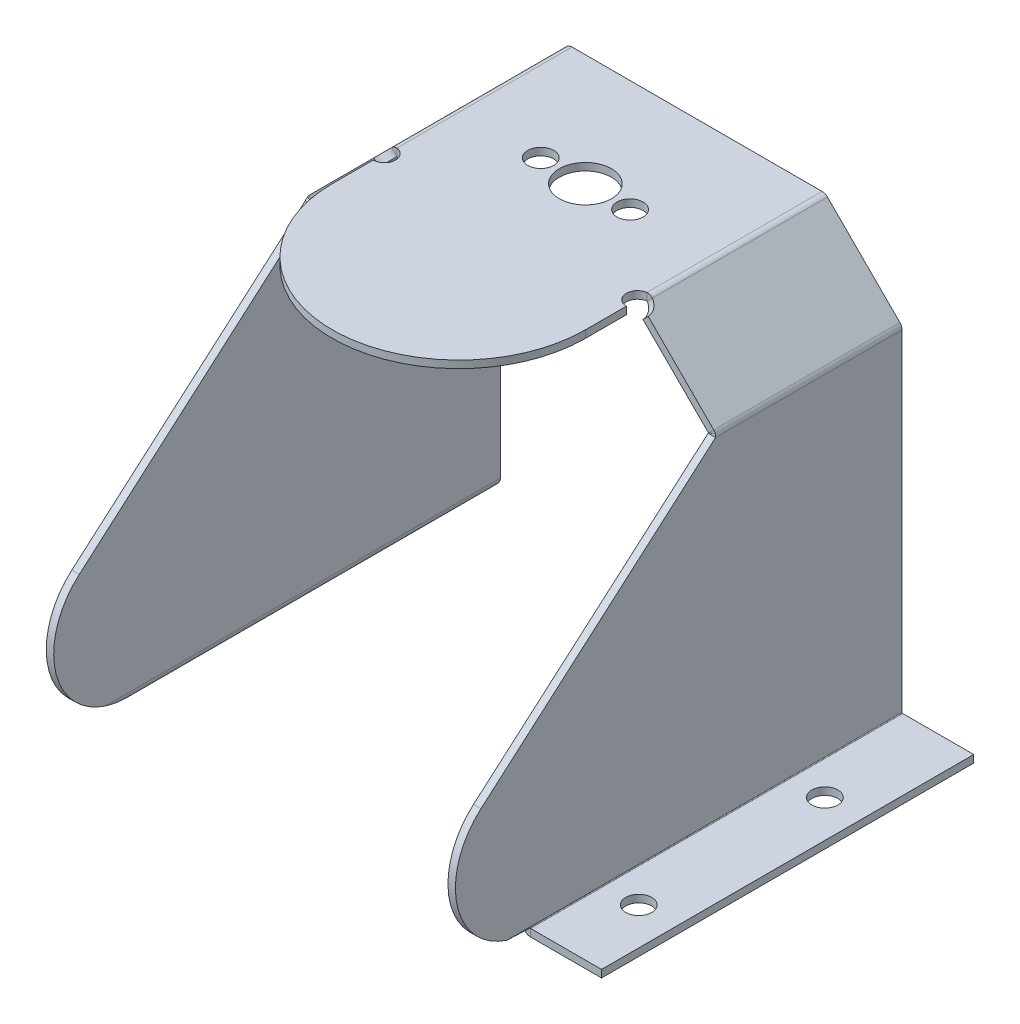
ISO-10303-21;
HEADER;
FILE_DESCRIPTION(('STEP AP214'),'2;1');
FILE_NAME('part.step','',(''),(''),'','','');
FILE_SCHEMA(('AUTOMOTIVE_DESIGN { 1 0 10303 214 1 1 1 1 }'));
ENDSEC;
DATA;
#1=APPLICATION_CONTEXT('core data for automotive mechanical design processes');
#2=APPLICATION_PROTOCOL_DEFINITION('international standard','automotive_design',2000,#1);
#3=PRODUCT_CONTEXT('',#1,'mechanical');
#4=PRODUCT('Part','Part','',(#3));
#5=PRODUCT_RELATED_PRODUCT_CATEGORY('part','',(#4));
#6=PRODUCT_DEFINITION_FORMATION('','',#4);
#7=PRODUCT_DEFINITION_CONTEXT('part definition',#1,'design');
#8=PRODUCT_DEFINITION('design','',#6,#7);
#9=PRODUCT_DEFINITION_SHAPE('','',#8);
#10=(LENGTH_UNIT() NAMED_UNIT(*) SI_UNIT(.MILLI.,.METRE.));
#11=(NAMED_UNIT(*) PLANE_ANGLE_UNIT() SI_UNIT($,.RADIAN.));
#12=(NAMED_UNIT(*) SI_UNIT($,.STERADIAN.) SOLID_ANGLE_UNIT());
#13=UNCERTAINTY_MEASURE_WITH_UNIT(LENGTH_MEASURE(1.E-05),#10,'distance_accuracy_value','');
#14=(GEOMETRIC_REPRESENTATION_CONTEXT(3) GLOBAL_UNCERTAINTY_ASSIGNED_CONTEXT((#13)) GLOBAL_UNIT_ASSIGNED_CONTEXT((#10,
#11,#12)) REPRESENTATION_CONTEXT('',''));
#15=CARTESIAN_POINT('',(0.,0.,0.));
#16=DIRECTION('',(0.,0.,1.));
#17=DIRECTION('',(1.,0.,0.));
#18=AXIS2_PLACEMENT_3D('',#15,#16,#17);
#19=CARTESIAN_POINT('',(17.,1.,24.9999957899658));
#20=DIRECTION('',(0.,-1.,0.));
#21=DIRECTION('',(0.,0.,-1.));
#22=AXIS2_PLACEMENT_3D('',#19,#20,#21);
#23=CYLINDRICAL_SURFACE('',#22,1.5);
#24=CARTESIAN_POINT('',(17.,0.,24.9999957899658));
#25=DIRECTION('',(0.,-1.,0.));
#26=DIRECTION('',(0.,0.,-1.));
#27=AXIS2_PLACEMENT_3D('',#24,#25,#26);
#28=CIRCLE('',#27,1.5);
#29=CARTESIAN_POINT('',(17.,0.,26.4999957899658));
#30=VERTEX_POINT('',#29);
#31=CARTESIAN_POINT('',(16.7997283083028,1.17596930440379E-08,23.5134254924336));
#32=VERTEX_POINT('',#31);
#33=EDGE_CURVE('E774',#30,#32,#28,.T.);
#34=ORIENTED_EDGE('',*,*,#33,.T.);
#35=DIRECTION('',(0.,1.,0.));
#36=VECTOR('',#35,1.);
#37=CARTESIAN_POINT('',(16.7997283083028,1.,23.5134254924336));
#38=LINE('',#37,#36);
#39=CARTESIAN_POINT('',(16.7997283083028,1.00000001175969,23.5134254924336));
#40=VERTEX_POINT('',#39);
#41=EDGE_CURVE('E815',#32,#40,#38,.T.);
#42=ORIENTED_EDGE('',*,*,#41,.T.);
#43=CARTESIAN_POINT('',(17.,1.,24.9999957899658));
#44=DIRECTION('',(0.,-1.,0.));
#45=DIRECTION('',(0.,0.,-1.));
#46=AXIS2_PLACEMENT_3D('',#43,#44,#45);
#47=CIRCLE('',#46,1.5);
#48=CARTESIAN_POINT('',(17.,1.,26.4999957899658));
#49=VERTEX_POINT('',#48);
#50=EDGE_CURVE('E782',#49,#40,#47,.T.);
#51=ORIENTED_EDGE('',*,*,#50,.F.);
#52=DIRECTION('',(0.,-1.,0.));
#53=VECTOR('',#52,1.);
#54=CARTESIAN_POINT('',(17.,1.,26.4999957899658));
#55=LINE('',#54,#53);
#56=EDGE_CURVE('E792',#49,#30,#55,.T.);
#57=ORIENTED_EDGE('',*,*,#56,.T.);
#58=EDGE_LOOP('',(#34,#42,#51,#57));
#59=FACE_BOUND('',#58,.T.);
#60=ADVANCED_FACE('F102',(#59),#23,.F.);
#61=CARTESIAN_POINT('',(-86.,1.,0.));
#62=DIRECTION('',(0.,0.,1.));
#63=DIRECTION('',(1.,0.,0.));
#64=AXIS2_PLACEMENT_3D('',#61,#62,#63);
#65=PLANE('',#64);
#66=DIRECTION('',(-1.,0.,0.));
#67=VECTOR('',#66,1.);
#68=CARTESIAN_POINT('',(-86.,1.,0.));
#69=LINE('',#68,#67);
#70=CARTESIAN_POINT('',(16.7997283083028,1.00000001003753,0.));
#71=VERTEX_POINT('',#70);
#72=CARTESIAN_POINT('',(-16.7997283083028,1.,0.));
#73=VERTEX_POINT('',#72);
#74=EDGE_CURVE('E106',#71,#73,#69,.T.);
#75=ORIENTED_EDGE('',*,*,#74,.F.);
#76=DIRECTION('',(0.,-1.,0.));
#77=VECTOR('',#76,1.);
#78=CARTESIAN_POINT('',(16.7997283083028,1.,0.));
#79=LINE('',#78,#77);
#80=CARTESIAN_POINT('',(16.7997283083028,0.,0.));
#81=VERTEX_POINT('',#80);
#82=EDGE_CURVE('E12',#71,#81,#79,.T.);
#83=ORIENTED_EDGE('',*,*,#82,.T.);
#84=DIRECTION('',(-1.,0.,0.));
#85=VECTOR('',#84,1.);
#86=CARTESIAN_POINT('',(-86.,0.,0.));
#87=LINE('',#86,#85);
#88=CARTESIAN_POINT('',(-16.7997283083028,0.,0.));
#89=VERTEX_POINT('',#88);
#90=EDGE_CURVE('E812',#81,#89,#87,.T.);
#91=ORIENTED_EDGE('',*,*,#90,.T.);
#92=DIRECTION('',(0.,-1.,0.));
#93=VECTOR('',#92,1.);
#94=CARTESIAN_POINT('',(-16.7997283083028,1.,0.));
#95=LINE('',#94,#93);
#96=EDGE_CURVE('E801',#73,#89,#95,.T.);
#97=ORIENTED_EDGE('',*,*,#96,.F.);
#98=EDGE_LOOP('',(#75,#83,#91,#97));
#99=FACE_BOUND('',#98,.T.);
#100=ADVANCED_FACE('F104',(#99),#65,.F.);
#101=CARTESIAN_POINT('',(0.,0.,32.));
#102=DIRECTION('',(0.,1.,0.));
#103=DIRECTION('',(0.,0.,1.));
#104=AXIS2_PLACEMENT_3D('',#101,#102,#103);
#105=PLANE('',#104);
#106=CARTESIAN_POINT('',(0.,0.,15.));
#107=DIRECTION('',(0.,1.,0.));
#108=DIRECTION('',(0.,0.,1.));
#109=AXIS2_PLACEMENT_3D('',#106,#107,#108);
#110=CIRCLE('',#109,3.5);
#111=CARTESIAN_POINT('',(0.,0.,18.5));
#112=VERTEX_POINT('',#111);
#113=EDGE_CURVE('E757',#112,#112,#110,.T.);
#114=ORIENTED_EDGE('',*,*,#113,.T.);
#115=EDGE_LOOP('',(#114));
#116=FACE_BOUND('',#115,.T.);
#117=CARTESIAN_POINT('',(6.,0.,15.));
#118=DIRECTION('',(0.,1.,0.));
#119=DIRECTION('',(0.,0.,-1.));
#120=AXIS2_PLACEMENT_3D('',#117,#118,#119);
#121=CIRCLE('',#120,1.75);
#122=CARTESIAN_POINT('',(6.,0.,13.25));
#123=VERTEX_POINT('',#122);
#124=EDGE_CURVE('E763',#123,#123,#121,.T.);
#125=ORIENTED_EDGE('',*,*,#124,.T.);
#126=EDGE_LOOP('',(#125));
#127=FACE_BOUND('',#126,.T.);
#128=CARTESIAN_POINT('',(-6.,0.,15.));
#129=DIRECTION('',(0.,1.,0.));
#130=DIRECTION('',(0.,0.,1.));
#131=AXIS2_PLACEMENT_3D('',#128,#129,#130);
#132=CIRCLE('',#131,1.75);
#133=CARTESIAN_POINT('',(-6.,0.,16.75));
#134=VERTEX_POINT('',#133);
#135=EDGE_CURVE('E746',#134,#134,#132,.T.);
#136=ORIENTED_EDGE('',*,*,#135,.T.);
#137=EDGE_LOOP('',(#136));
#138=FACE_BOUND('',#137,.T.);
#139=ORIENTED_EDGE('',*,*,#90,.F.);
#140=DIRECTION('',(0.,0.,1.));
#141=VECTOR('',#140,1.);
#142=CARTESIAN_POINT('',(16.7997283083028,0.,32.));
#143=LINE('',#142,#141);
#144=EDGE_CURVE('E111',#81,#32,#143,.T.);
#145=ORIENTED_EDGE('',*,*,#144,.T.);
#146=ORIENTED_EDGE('',*,*,#33,.F.);
#147=DIRECTION('',(0.,0.,-1.));
#148=VECTOR('',#147,1.);
#149=CARTESIAN_POINT('',(17.,0.,26.4999957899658));
#150=LINE('',#149,#148);
#151=CARTESIAN_POINT('',(17.,0.,32.));
#152=VERTEX_POINT('',#151);
#153=EDGE_CURVE('E772',#152,#30,#150,.T.);
#154=ORIENTED_EDGE('',*,*,#153,.F.);
#155=CARTESIAN_POINT('',(0.,0.,32.));
#156=DIRECTION('',(0.,1.,0.));
#157=DIRECTION('',(0.,0.,1.));
#158=AXIS2_PLACEMENT_3D('',#155,#156,#157);
#159=CIRCLE('',#158,17.);
#160=CARTESIAN_POINT('',(-17.,0.,32.));
#161=VERTEX_POINT('',#160);
#162=EDGE_CURVE('E769',#161,#152,#159,.T.);
#163=ORIENTED_EDGE('',*,*,#162,.F.);
#164=DIRECTION('',(0.,0.,1.));
#165=VECTOR('',#164,1.);
#166=CARTESIAN_POINT('',(-17.,0.,26.4999957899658));
#167=LINE('',#166,#165);
#168=CARTESIAN_POINT('',(-17.,0.,26.4999957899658));
#169=VERTEX_POINT('',#168);
#170=EDGE_CURVE('E775',#169,#161,#167,.T.);
#171=ORIENTED_EDGE('',*,*,#170,.F.);
#172=CARTESIAN_POINT('',(-17.,0.,24.9999957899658));
#173=DIRECTION('',(0.,-1.,0.));
#174=DIRECTION('',(0.,0.,1.));
#175=AXIS2_PLACEMENT_3D('',#172,#173,#174);
#176=CIRCLE('',#175,1.5);
#177=CARTESIAN_POINT('',(-16.7997283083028,0.,23.5134254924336));
#178=VERTEX_POINT('',#177);
#179=EDGE_CURVE('E127',#178,#169,#176,.T.);
#180=ORIENTED_EDGE('',*,*,#179,.F.);
#181=DIRECTION('',(0.,0.,1.));
#182=VECTOR('',#181,1.);
#183=CARTESIAN_POINT('',(-16.7997283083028,0.,32.));
#184=LINE('',#183,#182);
#185=EDGE_CURVE('E804',#89,#178,#184,.T.);
#186=ORIENTED_EDGE('',*,*,#185,.F.);
#187=EDGE_LOOP('',(#139,#145,#146,#154,#163,#171,#180,#186));
#188=FACE_BOUND('',#187,.T.);
#189=ADVANCED_FACE('F1132',(#116,#127,#138,#188),#105,.F.);
#190=CARTESIAN_POINT('',(0.,1.,32.));
#191=DIRECTION('',(0.,1.,0.));
#192=DIRECTION('',(0.,0.,1.));
#193=AXIS2_PLACEMENT_3D('',#190,#191,#192);
#194=PLANE('',#193);
#195=DIRECTION('',(0.,0.,1.));
#196=VECTOR('',#195,1.);
#197=CARTESIAN_POINT('',(16.7997283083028,1.,32.));
#198=LINE('',#197,#196);
#199=EDGE_CURVE('E810',#71,#40,#198,.T.);
#200=ORIENTED_EDGE('',*,*,#199,.F.);
#201=ORIENTED_EDGE('',*,*,#74,.T.);
#202=DIRECTION('',(0.,0.,1.));
#203=VECTOR('',#202,1.);
#204=CARTESIAN_POINT('',(-16.7997283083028,1.,32.));
#205=LINE('',#204,#203);
#206=CARTESIAN_POINT('',(-16.7997283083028,1.00000001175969,23.5134254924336));
#207=VERTEX_POINT('',#206);
#208=EDGE_CURVE('E798',#73,#207,#205,.T.);
#209=ORIENTED_EDGE('',*,*,#208,.T.);
#210=CARTESIAN_POINT('',(-17.,1.,24.9999957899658));
#211=DIRECTION('',(0.,-1.,0.));
#212=DIRECTION('',(0.,0.,1.));
#213=AXIS2_PLACEMENT_3D('',#210,#211,#212);
#214=CIRCLE('',#213,1.5);
#215=CARTESIAN_POINT('',(-17.,1.,26.4999957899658));
#216=VERTEX_POINT('',#215);
#217=EDGE_CURVE('E786',#207,#216,#214,.T.);
#218=ORIENTED_EDGE('',*,*,#217,.T.);
#219=DIRECTION('',(0.,0.,1.));
#220=VECTOR('',#219,1.);
#221=CARTESIAN_POINT('',(-17.,1.,26.4999957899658));
#222=LINE('',#221,#220);
#223=CARTESIAN_POINT('',(-17.,1.,32.));
#224=VERTEX_POINT('',#223);
#225=EDGE_CURVE('E783',#216,#224,#222,.T.);
#226=ORIENTED_EDGE('',*,*,#225,.T.);
#227=CARTESIAN_POINT('',(0.,1.,32.));
#228=DIRECTION('',(0.,1.,0.));
#229=DIRECTION('',(0.,0.,1.));
#230=AXIS2_PLACEMENT_3D('',#227,#228,#229);
#231=CIRCLE('',#230,17.);
#232=CARTESIAN_POINT('',(17.,1.,32.));
#233=VERTEX_POINT('',#232);
#234=EDGE_CURVE('E777',#224,#233,#231,.T.);
#235=ORIENTED_EDGE('',*,*,#234,.T.);
#236=DIRECTION('',(0.,0.,-1.));
#237=VECTOR('',#236,1.);
#238=CARTESIAN_POINT('',(17.,1.,26.4999957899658));
#239=LINE('',#238,#237);
#240=EDGE_CURVE('E780',#233,#49,#239,.T.);
#241=ORIENTED_EDGE('',*,*,#240,.T.);
#242=ORIENTED_EDGE('',*,*,#50,.T.);
#243=EDGE_LOOP('',(#200,#201,#209,#218,#226,#235,#241,#242));
#244=FACE_BOUND('',#243,.T.);
#245=CARTESIAN_POINT('',(-6.,1.,15.));
#246=DIRECTION('',(0.,1.,0.));
#247=DIRECTION('',(0.,0.,1.));
#248=AXIS2_PLACEMENT_3D('',#245,#246,#247);
#249=CIRCLE('',#248,1.75);
#250=CARTESIAN_POINT('',(-6.,1.,16.75));
#251=VERTEX_POINT('',#250);
#252=EDGE_CURVE('E754',#251,#251,#249,.T.);
#253=ORIENTED_EDGE('',*,*,#252,.F.);
#254=EDGE_LOOP('',(#253));
#255=FACE_BOUND('',#254,.T.);
#256=CARTESIAN_POINT('',(6.,1.,15.));
#257=DIRECTION('',(0.,1.,0.));
#258=DIRECTION('',(0.,0.,-1.));
#259=AXIS2_PLACEMENT_3D('',#256,#257,#258);
#260=CIRCLE('',#259,1.75);
#261=CARTESIAN_POINT('',(6.,1.,13.25));
#262=VERTEX_POINT('',#261);
#263=EDGE_CURVE('E766',#262,#262,#260,.T.);
#264=ORIENTED_EDGE('',*,*,#263,.F.);
#265=EDGE_LOOP('',(#264));
#266=FACE_BOUND('',#265,.T.);
#267=CARTESIAN_POINT('',(0.,1.,15.));
#268=DIRECTION('',(0.,1.,0.));
#269=DIRECTION('',(0.,0.,1.));
#270=AXIS2_PLACEMENT_3D('',#267,#268,#269);
#271=CIRCLE('',#270,3.5);
#272=CARTESIAN_POINT('',(0.,1.,18.5));
#273=VERTEX_POINT('',#272);
#274=EDGE_CURVE('E760',#273,#273,#271,.T.);
#275=ORIENTED_EDGE('',*,*,#274,.F.);
#276=EDGE_LOOP('',(#275));
#277=FACE_BOUND('',#276,.T.);
#278=ADVANCED_FACE('F828',(#244,#255,#266,#277),#194,.T.);
#279=CARTESIAN_POINT('',(0.,1.,32.));
#280=DIRECTION('',(0.,-1.,0.));
#281=DIRECTION('',(0.,0.,-1.));
#282=AXIS2_PLACEMENT_3D('',#279,#280,#281);
#283=CYLINDRICAL_SURFACE('',#282,17.);
#284=ORIENTED_EDGE('',*,*,#162,.T.);
#285=DIRECTION('',(0.,-1.,0.));
#286=VECTOR('',#285,1.);
#287=CARTESIAN_POINT('',(17.,1.,32.));
#288=LINE('',#287,#286);
#289=EDGE_CURVE('E795',#233,#152,#288,.T.);
#290=ORIENTED_EDGE('',*,*,#289,.F.);
#291=ORIENTED_EDGE('',*,*,#234,.F.);
#292=DIRECTION('',(0.,-1.,0.));
#293=VECTOR('',#292,1.);
#294=CARTESIAN_POINT('',(-17.,1.,32.));
#295=LINE('',#294,#293);
#296=EDGE_CURVE('E785',#224,#161,#295,.T.);
#297=ORIENTED_EDGE('',*,*,#296,.T.);
#298=EDGE_LOOP('',(#284,#290,#291,#297));
#299=FACE_BOUND('',#298,.T.);
#300=ADVANCED_FACE('F1196',(#299),#283,.T.);
#301=CARTESIAN_POINT('',(17.,1.,26.4999957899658));
#302=DIRECTION('',(-1.,0.,0.));
#303=DIRECTION('',(0.,0.,1.));
#304=AXIS2_PLACEMENT_3D('',#301,#302,#303);
#305=PLANE('',#304);
#306=ORIENTED_EDGE('',*,*,#153,.T.);
#307=ORIENTED_EDGE('',*,*,#56,.F.);
#308=ORIENTED_EDGE('',*,*,#240,.F.);
#309=ORIENTED_EDGE('',*,*,#289,.T.);
#310=EDGE_LOOP('',(#306,#307,#308,#309));
#311=FACE_BOUND('',#310,.T.);
#312=ADVANCED_FACE('F1224',(#311),#305,.F.);
#313=CARTESIAN_POINT('',(-17.,1.,24.9999957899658));
#314=DIRECTION('',(0.,-1.,0.));
#315=DIRECTION('',(0.,0.,-1.));
#316=AXIS2_PLACEMENT_3D('',#313,#314,#315);
#317=CYLINDRICAL_SURFACE('',#316,1.5);
#318=DIRECTION('',(0.,1.,0.));
#319=VECTOR('',#318,1.);
#320=CARTESIAN_POINT('',(-16.7997283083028,1.,23.5134254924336));
#321=LINE('',#320,#319);
#322=EDGE_CURVE('E807',#178,#207,#321,.T.);
#323=ORIENTED_EDGE('',*,*,#322,.F.);
#324=ORIENTED_EDGE('',*,*,#179,.T.);
#325=DIRECTION('',(0.,-1.,0.));
#326=VECTOR('',#325,1.);
#327=CARTESIAN_POINT('',(-17.,1.,26.4999957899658));
#328=LINE('',#327,#326);
#329=EDGE_CURVE('E789',#216,#169,#328,.T.);
#330=ORIENTED_EDGE('',*,*,#329,.F.);
#331=ORIENTED_EDGE('',*,*,#217,.F.);
#332=EDGE_LOOP('',(#323,#324,#330,#331));
#333=FACE_BOUND('',#332,.T.);
#334=ADVANCED_FACE('F1222',(#333),#317,.F.);
#335=CARTESIAN_POINT('',(-17.,1.,26.4999957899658));
#336=DIRECTION('',(1.,0.,0.));
#337=DIRECTION('',(0.,0.,-1.));
#338=AXIS2_PLACEMENT_3D('',#335,#336,#337);
#339=PLANE('',#338);
#340=ORIENTED_EDGE('',*,*,#170,.T.);
#341=ORIENTED_EDGE('',*,*,#296,.F.);
#342=ORIENTED_EDGE('',*,*,#225,.F.);
#343=ORIENTED_EDGE('',*,*,#329,.T.);
#344=EDGE_LOOP('',(#340,#341,#342,#343));
#345=FACE_BOUND('',#344,.T.);
#346=ADVANCED_FACE('F1218',(#345),#339,.F.);
#347=CARTESIAN_POINT('',(6.,1.,15.));
#348=DIRECTION('',(0.,-1.,0.));
#349=DIRECTION('',(0.,0.,-1.));
#350=AXIS2_PLACEMENT_3D('',#347,#348,#349);
#351=CYLINDRICAL_SURFACE('',#350,1.75);
#352=ORIENTED_EDGE('',*,*,#263,.T.);
#353=EDGE_LOOP('',(#352));
#354=FACE_BOUND('',#353,.T.);
#355=ORIENTED_EDGE('',*,*,#124,.F.);
#356=EDGE_LOOP('',(#355));
#357=FACE_BOUND('',#356,.T.);
#358=ADVANCED_FACE('F1212',(#354,#357),#351,.F.);
#359=CARTESIAN_POINT('',(0.,1.,15.));
#360=DIRECTION('',(0.,-1.,0.));
#361=DIRECTION('',(0.,0.,-1.));
#362=AXIS2_PLACEMENT_3D('',#359,#360,#361);
#363=CYLINDRICAL_SURFACE('',#362,3.5);
#364=ORIENTED_EDGE('',*,*,#274,.T.);
#365=EDGE_LOOP('',(#364));
#366=FACE_BOUND('',#365,.T.);
#367=ORIENTED_EDGE('',*,*,#113,.F.);
#368=EDGE_LOOP('',(#367));
#369=FACE_BOUND('',#368,.T.);
#370=ADVANCED_FACE('F1205',(#366,#369),#363,.F.);
#371=CARTESIAN_POINT('',(-6.,1.,15.));
#372=DIRECTION('',(0.,-1.,0.));
#373=DIRECTION('',(0.,0.,-1.));
#374=AXIS2_PLACEMENT_3D('',#371,#372,#373);
#375=CYLINDRICAL_SURFACE('',#374,1.75);
#376=ORIENTED_EDGE('',*,*,#252,.T.);
#377=EDGE_LOOP('',(#376));
#378=FACE_BOUND('',#377,.T.);
#379=ORIENTED_EDGE('',*,*,#135,.F.);
#380=EDGE_LOOP('',(#379));
#381=FACE_BOUND('',#380,.T.);
#382=ADVANCED_FACE('F1203',(#378,#381),#375,.F.);
#383=CARTESIAN_POINT('',(-16.7997283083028,-0.0100000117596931,0.));
#384=DIRECTION('',(0.,0.,-1.));
#385=DIRECTION('',(0.,1.,0.));
#386=AXIS2_PLACEMENT_3D('',#383,#384,#385);
#387=PLANE('',#386);
#388=ORIENTED_EDGE('',*,*,#96,.T.);
#389=CARTESIAN_POINT('',(-16.7997283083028,-0.01,0.));
#390=DIRECTION('',(0.,0.,1.));
#391=DIRECTION('',(1.,0.,0.));
#392=AXIS2_PLACEMENT_3D('',#389,#390,#391);
#393=CIRCLE('',#392,0.0100000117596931);
#394=CARTESIAN_POINT('',(-16.8067993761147,-0.00292893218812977,0.));
#395=VERTEX_POINT('',#394);
#396=EDGE_CURVE('E709',#89,#395,#393,.T.);
#397=ORIENTED_EDGE('',*,*,#396,.T.);
#398=DIRECTION('',(0.707106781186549,-0.707106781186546,0.));
#399=VECTOR('',#398,1.);
#400=CARTESIAN_POINT('',(-17.5139061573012,0.704177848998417,0.));
#401=LINE('',#400,#399);
#402=CARTESIAN_POINT('',(-17.5139061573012,0.704177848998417,0.));
#403=VERTEX_POINT('',#402);
#404=EDGE_CURVE('E840',#403,#395,#401,.T.);
#405=ORIENTED_EDGE('',*,*,#404,.F.);
#406=CARTESIAN_POINT('',(-16.7997283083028,-0.0100000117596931,0.));
#407=DIRECTION('',(0.,0.,1.));
#408=DIRECTION('',(0.,-1.,0.));
#409=AXIS2_PLACEMENT_3D('',#406,#407,#408);
#410=CIRCLE('',#409,1.01000002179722);
#411=EDGE_CURVE('E718',#73,#403,#410,.T.);
#412=ORIENTED_EDGE('',*,*,#411,.F.);
#413=EDGE_LOOP('',(#388,#397,#405,#412));
#414=FACE_BOUND('',#413,.T.);
#415=ADVANCED_FACE('F740',(#414),#387,.T.);
#416=CARTESIAN_POINT('',(-16.7997283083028,-0.01,23.5134267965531));
#417=DIRECTION('',(0.,0.,-1.));
#418=DIRECTION('',(-1.,0.,0.));
#419=AXIS2_PLACEMENT_3D('',#416,#417,#418);
#420=PLANE('',#419);
#421=CARTESIAN_POINT('',(-16.8067993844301,-0.00292892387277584,23.5134267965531));
#422=CARTESIAN_POINT('',(-16.8066836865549,-0.00281322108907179,23.513426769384));
#423=CARTESIAN_POINT('',(-16.806565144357,-0.00270036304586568,23.5134267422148));
#424=CARTESIAN_POINT('',(-16.8063226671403,-0.0024805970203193,23.5134266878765));
#425=CARTESIAN_POINT('',(-16.8061987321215,-0.00237368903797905,23.5134266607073));
#426=CARTESIAN_POINT('',(-16.805945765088,-0.00216608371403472,23.513426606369));
#427=CARTESIAN_POINT('',(-16.8058167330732,-0.00206538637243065,23.5134265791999));
#428=CARTESIAN_POINT('',(-16.8055538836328,-0.00187044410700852,23.5134265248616));
#429=CARTESIAN_POINT('',(-16.8054200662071,-0.00177619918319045,23.5134264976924));
#430=CARTESIAN_POINT('',(-16.8051479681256,-0.00159438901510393,23.5134264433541));
#431=CARTESIAN_POINT('',(-16.8050096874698,-0.00150682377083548,23.5134264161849));
#432=CARTESIAN_POINT('',(-16.8047289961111,-0.00133858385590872,23.5134263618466));
#433=CARTESIAN_POINT('',(-16.8045865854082,-0.00125790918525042,23.5134263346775));
#434=CARTESIAN_POINT('',(-16.804297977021,-0.00110364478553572,23.5134262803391));
#435=CARTESIAN_POINT('',(-16.8041517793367,-0.00103005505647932,23.51342625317));
#436=CARTESIAN_POINT('',(-16.8038559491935,-0.000890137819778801,23.5134261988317));
#437=CARTESIAN_POINT('',(-16.8037063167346,-0.000823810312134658,23.5134261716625));
#438=CARTESIAN_POINT('',(-16.8034039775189,-0.000698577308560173,23.5134261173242));
#439=CARTESIAN_POINT('',(-16.8032512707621,-0.000639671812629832,23.5134260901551));
#440=CARTESIAN_POINT('',(-16.8029431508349,-0.000529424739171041,23.5134260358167));
#441=CARTESIAN_POINT('',(-16.8027877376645,-0.000478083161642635,23.5134260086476));
#442=CARTESIAN_POINT('',(-16.8024745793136,-0.000383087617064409,23.5134259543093));
#443=CARTESIAN_POINT('',(-16.8023168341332,-0.000339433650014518,23.5134259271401));
#444=CARTESIAN_POINT('',(-16.8019993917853,-0.000259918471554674,23.5134258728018));
#445=CARTESIAN_POINT('',(-16.8018396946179,-0.000224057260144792,23.5134258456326));
#446=CARTESIAN_POINT('',(-16.8015187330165,-0.000160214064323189,23.5134257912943));
#447=CARTESIAN_POINT('',(-16.8013574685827,-0.000132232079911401,23.5134257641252));
#448=CARTESIAN_POINT('',(-16.8010337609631,-8.42144559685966E-05,23.5134257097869));
#449=CARTESIAN_POINT('',(-16.8008713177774,-6.41788164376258E-05,23.5134256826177));
#450=CARTESIAN_POINT('',(-16.8005456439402,-3.21032439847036E-05,23.5134256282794));
#451=CARTESIAN_POINT('',(-16.8003824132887,-2.00633110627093E-05,23.5134256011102));
#452=CARTESIAN_POINT('',(-16.8000555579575,-4.00407377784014E-06,23.5134255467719));
#453=CARTESIAN_POINT('',(-16.7998919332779,1.52305849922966E-08,23.5134255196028));
#454=CARTESIAN_POINT('',(-16.7997283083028,1.17596930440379E-08,23.5134254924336));
#455=B_SPLINE_CURVE_WITH_KNOTS('',3,(#421,#422,#423,#424,#425,#426,#427,#428,#429,#430,#431,
#432,#433,#434,#435,#436,#437,#438,#439,#440,#441,#442,#443,#444,#445,#446,#447,#448,#449,#450,
#451,#452,#453,#454),.UNSPECIFIED.,.F.,.F.,(4,2,2,2,2,2,2,2,2,2,2,2,2,2,2,2,4),(0.,
0.000490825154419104,0.000981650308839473,0.00147247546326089,0.00196330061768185,
0.00245412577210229,0.0029449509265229,0.0034357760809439,0.00392660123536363,
0.00441742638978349,0.0049082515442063,0.00539907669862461,0.00588990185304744,
0.00638072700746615,0.00687155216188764,0.0073623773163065,0.00785320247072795),.UNSPECIFIED.);
#456=CARTESIAN_POINT('',(-16.8067993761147,-0.00292893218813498,23.5134267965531));
#457=VERTEX_POINT('',#456);
#458=EDGE_CURVE('E712',#457,#178,#455,.T.);
#459=ORIENTED_EDGE('',*,*,#458,.T.);
#460=ORIENTED_EDGE('',*,*,#322,.T.);
#461=CARTESIAN_POINT('',(-17.5139061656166,0.704177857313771,23.5134267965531));
#462=CARTESIAN_POINT('',(-17.502220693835,0.71586382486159,23.513426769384));
#463=CARTESIAN_POINT('',(-17.4902479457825,0.727262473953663,23.5134267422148));
#464=CARTESIAN_POINT('',(-17.4657577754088,0.749458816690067,23.5134266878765));
#465=CARTESIAN_POINT('',(-17.4532403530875,0.760256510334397,23.5134266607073));
#466=CARTESIAN_POINT('',(-17.4276907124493,0.781224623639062,23.513426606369));
#467=CARTESIAN_POINT('',(-17.4146584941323,0.791395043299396,23.5134265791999));
#468=CARTESIAN_POINT('',(-17.3881107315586,0.811084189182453,23.5134265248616));
#469=CARTESIAN_POINT('',(-17.3745951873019,0.820602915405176,23.5134264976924));
#470=CARTESIAN_POINT('',(-17.34711331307,0.838965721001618,23.5134264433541));
#471=CARTESIAN_POINT('',(-17.3331469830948,0.847809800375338,23.5134264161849));
#472=CARTESIAN_POINT('',(-17.3047971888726,0.864802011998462,23.5134263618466));
#473=CARTESIAN_POINT('',(-17.2904137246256,0.872950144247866,23.5134263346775));
#474=CARTESIAN_POINT('',(-17.2612643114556,0.888530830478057,23.5134262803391));
#475=CARTESIAN_POINT('',(-17.2464983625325,0.895963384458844,23.51342625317));
#476=CARTESIAN_POINT('',(-17.2166195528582,0.910095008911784,23.5134261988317));
#477=CARTESIAN_POINT('',(-17.2015066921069,0.916794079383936,23.5134261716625));
#478=CARTESIAN_POINT('',(-17.1709704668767,0.929442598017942,23.5134261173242));
#479=CARTESIAN_POINT('',(-17.1555471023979,0.935392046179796,23.5134260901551));
#480=CARTESIAN_POINT('',(-17.1244270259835,0.946526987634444,23.5134260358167));
#481=CARTESIAN_POINT('',(-17.108730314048,0.95171248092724,23.5134260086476));
#482=CARTESIAN_POINT('',(-17.077101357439,0.961307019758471,23.5134259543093));
#483=CARTESIAN_POINT('',(-17.0611691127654,0.965716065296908,23.5134259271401));
#484=CARTESIAN_POINT('',(-17.0291074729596,0.97374708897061,23.5134258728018));
#485=CARTESIAN_POINT('',(-17.0129780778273,0.977369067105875,23.5134258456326));
#486=CARTESIAN_POINT('',(-16.9805609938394,0.983817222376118,23.5134257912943));
#487=CARTESIAN_POINT('',(-16.9642733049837,0.986643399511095,23.5134257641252));
#488=CARTESIAN_POINT('',(-16.9315788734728,0.991493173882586,23.5134257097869));
#489=CARTESIAN_POINT('',(-16.9151721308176,0.9935167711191,23.5134256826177));
#490=CARTESIAN_POINT('',(-16.882279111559,0.996756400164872,23.5134256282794));
#491=CARTESIAN_POINT('',(-16.8657928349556,0.997972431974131,23.5134256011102));
#492=CARTESIAN_POINT('',(-16.8327804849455,0.999594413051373,23.5134255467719));
#493=CARTESIAN_POINT('',(-16.8162544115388,1.00000036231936,23.5134255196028));
#494=CARTESIAN_POINT('',(-16.7997283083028,1.00000001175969,23.5134254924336));
#495=B_SPLINE_CURVE_WITH_KNOTS('',3,(#461,#462,#463,#464,#465,#466,#467,#468,#469,#470,#471,
#472,#473,#474,#475,#476,#477,#478,#479,#480,#481,#482,#483,#484,#485,#486,#487,#488,#489,#490,
#491,#492,#493,#494),.UNSPECIFIED.,.F.,.F.,(4,2,2,2,2,2,2,2,2,2,2,2,2,2,2,2,4),(0.,
0.0495732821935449,0.0991465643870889,0.148719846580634,0.198293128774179,0.247866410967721,
0.297439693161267,0.347012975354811,0.396586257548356,0.446159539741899,0.495732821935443,
0.54530610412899,0.594879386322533,0.644452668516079,0.694025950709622,0.743599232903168,
0.793172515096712),.UNSPECIFIED.);
#496=CARTESIAN_POINT('',(-17.5139061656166,0.704177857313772,23.5134267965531));
#497=VERTEX_POINT('',#496);
#498=EDGE_CURVE('E742',#497,#207,#495,.T.);
#499=ORIENTED_EDGE('',*,*,#498,.F.);
#500=DIRECTION('',(-0.707106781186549,0.707106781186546,0.));
#501=VECTOR('',#500,1.);
#502=CARTESIAN_POINT('',(-17.5139061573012,0.704177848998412,23.5134267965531));
#503=LINE('',#502,#501);
#504=EDGE_CURVE('E1119',#457,#497,#503,.T.);
#505=ORIENTED_EDGE('',*,*,#504,.F.);
#506=EDGE_LOOP('',(#459,#460,#499,#505));
#507=FACE_BOUND('',#506,.T.);
#508=ADVANCED_FACE('F733',(#507),#420,.F.);
#509=CARTESIAN_POINT('',(-16.7997283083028,-0.01,-11.7813772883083));
#510=DIRECTION('',(0.,0.,1.));
#511=DIRECTION('',(1.,0.,0.));
#512=AXIS2_PLACEMENT_3D('',#509,#510,#511);
#513=CYLINDRICAL_SURFACE('',#512,1.01000001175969);
#514=DIRECTION('',(0.,0.,1.));
#515=VECTOR('',#514,1.);
#516=CARTESIAN_POINT('',(-17.5139061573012,0.704177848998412,32.));
#517=LINE('',#516,#515);
#518=EDGE_CURVE('E567',#403,#497,#517,.T.);
#519=ORIENTED_EDGE('',*,*,#518,.T.);
#520=ORIENTED_EDGE('',*,*,#498,.T.);
#521=ORIENTED_EDGE('',*,*,#208,.F.);
#522=ORIENTED_EDGE('',*,*,#411,.T.);
#523=EDGE_LOOP('',(#519,#520,#521,#522));
#524=FACE_BOUND('',#523,.T.);
#525=ADVANCED_FACE('F731',(#524),#513,.T.);
#526=CARTESIAN_POINT('',(-16.7997283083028,-0.01,-11.7813772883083));
#527=DIRECTION('',(0.,0.,1.));
#528=DIRECTION('',(1.,0.,0.));
#529=AXIS2_PLACEMENT_3D('',#526,#527,#528);
#530=CYLINDRICAL_SURFACE('',#529,0.0100000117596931);
#531=DIRECTION('',(0.,0.,1.));
#532=VECTOR('',#531,1.);
#533=CARTESIAN_POINT('',(-16.8067993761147,-0.00292893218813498,32.));
#534=LINE('',#533,#532);
#535=EDGE_CURVE('E847',#395,#457,#534,.T.);
#536=ORIENTED_EDGE('',*,*,#535,.F.);
#537=ORIENTED_EDGE('',*,*,#396,.F.);
#538=ORIENTED_EDGE('',*,*,#185,.T.);
#539=ORIENTED_EDGE('',*,*,#458,.F.);
#540=EDGE_LOOP('',(#536,#537,#538,#539));
#541=FACE_BOUND('',#540,.T.);
#542=ADVANCED_FACE('F720',(#541),#530,.F.);
#543=CARTESIAN_POINT('',(-32.0547505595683,-54.0547408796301,15.));
#544=DIRECTION('',(0.,-1.,0.));
#545=DIRECTION('',(0.,0.,-1.));
#546=AXIS2_PLACEMENT_3D('',#543,#544,#545);
#547=CYLINDRICAL_SURFACE('',#546,1.75);
#548=CARTESIAN_POINT('',(-32.0547505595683,-54.0547408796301,15.));
#549=DIRECTION('',(0.,1.,0.));
#550=DIRECTION('',(0.,0.,1.));
#551=AXIS2_PLACEMENT_3D('',#548,#549,#550);
#552=CIRCLE('',#551,1.75);
#553=CARTESIAN_POINT('',(-32.0547505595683,-54.0547408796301,16.75));
#554=VERTEX_POINT('',#553);
#555=EDGE_CURVE('E704',#554,#554,#552,.T.);
#556=ORIENTED_EDGE('',*,*,#555,.T.);
#557=EDGE_LOOP('',(#556));
#558=FACE_BOUND('',#557,.T.);
#559=CARTESIAN_POINT('',(-32.0547505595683,-55.0547408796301,15.));
#560=DIRECTION('',(0.,1.,0.));
#561=DIRECTION('',(0.,0.,1.));
#562=AXIS2_PLACEMENT_3D('',#559,#560,#561);
#563=CIRCLE('',#562,1.75);
#564=CARTESIAN_POINT('',(-32.0547505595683,-55.0547408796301,16.75));
#565=VERTEX_POINT('',#564);
#566=EDGE_CURVE('E683',#565,#565,#563,.T.);
#567=ORIENTED_EDGE('',*,*,#566,.F.);
#568=EDGE_LOOP('',(#567));
#569=FACE_BOUND('',#568,.T.);
#570=ADVANCED_FACE('F730',(#558,#569),#547,.F.);
#571=CARTESIAN_POINT('',(-32.0547505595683,-54.0547408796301,40.));
#572=DIRECTION('',(0.,-1.,0.));
#573=DIRECTION('',(0.,0.,-1.));
#574=AXIS2_PLACEMENT_3D('',#571,#572,#573);
#575=CYLINDRICAL_SURFACE('',#574,1.75);
#576=CARTESIAN_POINT('',(-32.0547505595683,-54.0547408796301,40.));
#577=DIRECTION('',(0.,1.,0.));
#578=DIRECTION('',(0.,0.,1.));
#579=AXIS2_PLACEMENT_3D('',#576,#577,#578);
#580=CIRCLE('',#579,1.75);
#581=CARTESIAN_POINT('',(-32.0547505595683,-54.0547408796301,41.75));
#582=VERTEX_POINT('',#581);
#583=EDGE_CURVE('E701',#582,#582,#580,.T.);
#584=ORIENTED_EDGE('',*,*,#583,.T.);
#585=EDGE_LOOP('',(#584));
#586=FACE_BOUND('',#585,.T.);
#587=CARTESIAN_POINT('',(-32.0547505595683,-55.0547408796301,40.));
#588=DIRECTION('',(0.,1.,0.));
#589=DIRECTION('',(0.,0.,1.));
#590=AXIS2_PLACEMENT_3D('',#587,#588,#589);
#591=CIRCLE('',#590,1.75);
#592=CARTESIAN_POINT('',(-32.0547505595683,-55.0547408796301,41.75));
#593=VERTEX_POINT('',#592);
#594=EDGE_CURVE('E686',#593,#593,#591,.T.);
#595=ORIENTED_EDGE('',*,*,#594,.F.);
#596=EDGE_LOOP('',(#595));
#597=FACE_BOUND('',#596,.T.);
#598=ADVANCED_FACE('F1431',(#586,#597),#575,.F.);
#599=CARTESIAN_POINT('',(-37.0547505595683,-54.0547408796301,0.));
#600=DIRECTION('',(1.,0.,0.));
#601=DIRECTION('',(0.,0.,-1.));
#602=AXIS2_PLACEMENT_3D('',#599,#600,#601);
#603=PLANE('',#602);
#604=DIRECTION('',(0.,0.,1.));
#605=VECTOR('',#604,1.);
#606=CARTESIAN_POINT('',(-37.0547505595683,-55.0547408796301,0.));
#607=LINE('',#606,#605);
#608=CARTESIAN_POINT('',(-37.0547505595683,-55.0547408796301,0.));
#609=VERTEX_POINT('',#608);
#610=CARTESIAN_POINT('',(-37.0547505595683,-55.0547408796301,50.));
#611=VERTEX_POINT('',#610);
#612=EDGE_CURVE('E699',#609,#611,#607,.T.);
#613=ORIENTED_EDGE('',*,*,#612,.T.);
#614=DIRECTION('',(0.,-1.,0.));
#615=VECTOR('',#614,1.);
#616=CARTESIAN_POINT('',(-37.0547505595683,-54.0547408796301,50.));
#617=LINE('',#616,#615);
#618=CARTESIAN_POINT('',(-37.0547505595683,-54.0547408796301,50.));
#619=VERTEX_POINT('',#618);
#620=EDGE_CURVE('E689',#619,#611,#617,.T.);
#621=ORIENTED_EDGE('',*,*,#620,.F.);
#622=DIRECTION('',(0.,0.,1.));
#623=VECTOR('',#622,1.);
#624=CARTESIAN_POINT('',(-37.0547505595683,-54.0547408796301,0.));
#625=LINE('',#624,#623);
#626=CARTESIAN_POINT('',(-37.0547505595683,-54.0547408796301,0.));
#627=VERTEX_POINT('',#626);
#628=EDGE_CURVE('E671',#627,#619,#625,.T.);
#629=ORIENTED_EDGE('',*,*,#628,.F.);
#630=DIRECTION('',(0.,-1.,0.));
#631=VECTOR('',#630,1.);
#632=CARTESIAN_POINT('',(-37.0547505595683,-54.0547408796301,0.));
#633=LINE('',#632,#631);
#634=EDGE_CURVE('E696',#627,#609,#633,.T.);
#635=ORIENTED_EDGE('',*,*,#634,.T.);
#636=EDGE_LOOP('',(#613,#621,#629,#635));
#637=FACE_BOUND('',#636,.T.);
#638=ADVANCED_FACE('F1423',(#637),#603,.F.);
#639=CARTESIAN_POINT('',(-37.0547505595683,-54.0547408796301,50.));
#640=DIRECTION('',(0.,0.,-1.));
#641=DIRECTION('',(-1.,0.,0.));
#642=AXIS2_PLACEMENT_3D('',#639,#640,#641);
#643=PLANE('',#642);
#644=DIRECTION('',(1.,0.,0.));
#645=VECTOR('',#644,1.);
#646=CARTESIAN_POINT('',(-37.0547505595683,-55.0547408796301,50.));
#647=LINE('',#646,#645);
#648=CARTESIAN_POINT('',(-27.5259894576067,-55.0547408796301,50.));
#649=VERTEX_POINT('',#648);
#650=EDGE_CURVE('E694',#611,#649,#647,.T.);
#651=ORIENTED_EDGE('',*,*,#650,.T.);
#652=DIRECTION('',(0.,1.,0.));
#653=VECTOR('',#652,1.);
#654=CARTESIAN_POINT('',(-27.5259894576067,-54.0547408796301,50.));
#655=LINE('',#654,#653);
#656=CARTESIAN_POINT('',(-27.5259894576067,-54.0547409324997,50.));
#657=VERTEX_POINT('',#656);
#658=EDGE_CURVE('E692',#649,#657,#655,.T.);
#659=ORIENTED_EDGE('',*,*,#658,.T.);
#660=DIRECTION('',(1.,0.,0.));
#661=VECTOR('',#660,1.);
#662=CARTESIAN_POINT('',(-37.0547505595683,-54.0547408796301,50.));
#663=LINE('',#662,#661);
#664=EDGE_CURVE('E668',#619,#657,#663,.T.);
#665=ORIENTED_EDGE('',*,*,#664,.F.);
#666=ORIENTED_EDGE('',*,*,#620,.T.);
#667=EDGE_LOOP('',(#651,#659,#665,#666));
#668=FACE_BOUND('',#667,.T.);
#669=ADVANCED_FACE('F1415',(#668),#643,.F.);
#670=CARTESIAN_POINT('',(48.9452494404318,-55.0547408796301,32.));
#671=DIRECTION('',(0.,1.,0.));
#672=DIRECTION('',(0.,0.,1.));
#673=AXIS2_PLACEMENT_3D('',#670,#671,#672);
#674=PLANE('',#673);
#675=ORIENTED_EDGE('',*,*,#594,.T.);
#676=EDGE_LOOP('',(#675));
#677=FACE_BOUND('',#676,.T.);
#678=ORIENTED_EDGE('',*,*,#566,.T.);
#679=EDGE_LOOP('',(#678));
#680=FACE_BOUND('',#679,.T.);
#681=DIRECTION('',(-1.,0.,0.));
#682=VECTOR('',#681,1.);
#683=CARTESIAN_POINT('',(-37.0547505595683,-55.0547408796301,0.));
#684=LINE('',#683,#682);
#685=CARTESIAN_POINT('',(-27.5259894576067,-55.0547408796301,0.));
#686=VERTEX_POINT('',#685);
#687=EDGE_CURVE('E675',#686,#609,#684,.T.);
#688=ORIENTED_EDGE('',*,*,#687,.F.);
#689=DIRECTION('',(0.,0.,1.));
#690=VECTOR('',#689,1.);
#691=CARTESIAN_POINT('',(-27.5259894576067,-55.0547408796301,32.));
#692=LINE('',#691,#690);
#693=EDGE_CURVE('E680',#686,#649,#692,.T.);
#694=ORIENTED_EDGE('',*,*,#693,.T.);
#695=ORIENTED_EDGE('',*,*,#650,.F.);
#696=ORIENTED_EDGE('',*,*,#612,.F.);
#697=EDGE_LOOP('',(#688,#694,#695,#696));
#698=FACE_BOUND('',#697,.T.);
#699=ADVANCED_FACE('F1408',(#677,#680,#698),#674,.F.);
#700=CARTESIAN_POINT('',(-37.0547505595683,-54.0547408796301,0.));
#701=DIRECTION('',(0.,0.,1.));
#702=DIRECTION('',(1.,0.,0.));
#703=AXIS2_PLACEMENT_3D('',#700,#701,#702);
#704=PLANE('',#703);
#705=DIRECTION('',(-1.,0.,0.));
#706=VECTOR('',#705,1.);
#707=CARTESIAN_POINT('',(-37.0547505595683,-54.0547408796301,0.));
#708=LINE('',#707,#706);
#709=CARTESIAN_POINT('',(-27.5259894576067,-54.0547408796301,0.));
#710=VERTEX_POINT('',#709);
#711=EDGE_CURVE('E673',#710,#627,#708,.T.);
#712=ORIENTED_EDGE('',*,*,#711,.F.);
#713=DIRECTION('',(0.,-1.,0.));
#714=VECTOR('',#713,1.);
#715=CARTESIAN_POINT('',(-27.5259894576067,-54.0547408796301,0.));
#716=LINE('',#715,#714);
#717=EDGE_CURVE('E677',#710,#686,#716,.T.);
#718=ORIENTED_EDGE('',*,*,#717,.T.);
#719=ORIENTED_EDGE('',*,*,#687,.T.);
#720=ORIENTED_EDGE('',*,*,#634,.F.);
#721=EDGE_LOOP('',(#712,#718,#719,#720));
#722=FACE_BOUND('',#721,.T.);
#723=ADVANCED_FACE('F1402',(#722),#704,.F.);
#724=CARTESIAN_POINT('',(48.9452494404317,-54.0547408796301,32.));
#725=DIRECTION('',(0.,1.,0.));
#726=DIRECTION('',(0.,0.,1.));
#727=AXIS2_PLACEMENT_3D('',#724,#725,#726);
#728=PLANE('',#727);
#729=DIRECTION('',(0.,0.,1.));
#730=VECTOR('',#729,1.);
#731=CARTESIAN_POINT('',(-27.5259894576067,-54.0547408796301,32.));
#732=LINE('',#731,#730);
#733=EDGE_CURVE('E640',#710,#657,#732,.T.);
#734=ORIENTED_EDGE('',*,*,#733,.F.);
#735=ORIENTED_EDGE('',*,*,#711,.T.);
#736=ORIENTED_EDGE('',*,*,#628,.T.);
#737=ORIENTED_EDGE('',*,*,#664,.T.);
#738=EDGE_LOOP('',(#734,#735,#736,#737));
#739=FACE_BOUND('',#738,.T.);
#740=ORIENTED_EDGE('',*,*,#583,.F.);
#741=EDGE_LOOP('',(#740));
#742=FACE_BOUND('',#741,.T.);
#743=ORIENTED_EDGE('',*,*,#555,.F.);
#744=EDGE_LOOP('',(#743));
#745=FACE_BOUND('',#744,.T.);
#746=ADVANCED_FACE('F597',(#739,#742,#745),#728,.T.);
#747=CARTESIAN_POINT('',(-26.7481719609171,-54.7325583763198,50.));
#748=CARTESIAN_POINT('',(-26.6463545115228,-54.6307409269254,50.5056063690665));
#749=CARTESIAN_POINT('',(-26.5648243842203,-54.5087217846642,51.0111990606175));
#750=CARTESIAN_POINT('',(-26.454619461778,-54.2426635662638,52.0223981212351));
#751=CARTESIAN_POINT('',(-26.4259894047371,-54.0987324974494,52.5279908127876));
#752=CARTESIAN_POINT('',(-26.4259894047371,-53.9547408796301,53.0335971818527));
#753=CARTESIAN_POINT('',(-27.4552787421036,-54.0254515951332,50.));
#754=CARTESIAN_POINT('',(-27.446022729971,-54.0161955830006,50.5055995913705));
#755=CARTESIAN_POINT('',(-27.4386107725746,-54.0051028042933,51.0111990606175));
#756=CARTESIAN_POINT('',(-27.4285921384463,-53.9809156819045,52.0223981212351));
#757=CARTESIAN_POINT('',(-27.4259894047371,-53.9678308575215,52.5279975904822));
#758=CARTESIAN_POINT('',(-27.4259894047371,-53.9547408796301,53.0335971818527));
#759=B_SPLINE_SURFACE_WITH_KNOTS('',1,3,((#747,#748,#749,#750,#751,#752),(#753,#754,#755,#756,
#757,#758)),.UNSPECIFIED.,.F.,.F.,.F.,(2,2),(4,2,4),(0.,1.),(0.,0.5,1.),.UNSPECIFIED.);
#760=CARTESIAN_POINT('',(-26.7481719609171,-54.7325583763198,50.));
#761=CARTESIAN_POINT('',(-26.6463545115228,-54.6307409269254,50.5056063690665));
#762=CARTESIAN_POINT('',(-26.5648243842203,-54.5087217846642,51.0111990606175));
#763=CARTESIAN_POINT('',(-26.454619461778,-54.2426635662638,52.0223981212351));
#764=CARTESIAN_POINT('',(-26.4259894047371,-54.0987324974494,52.5279908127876));
#765=CARTESIAN_POINT('',(-26.4259894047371,-53.9547408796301,53.0335971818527));
#766=B_SPLINE_CURVE_WITH_KNOTS('',3,(#760,#761,#762,#763,#764,#765),.UNSPECIFIED.,.F.,.F.,(4,2,
4),(0.,0.5,1.),.UNSPECIFIED.);
#767=CARTESIAN_POINT('',(-26.7481719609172,-54.7325583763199,50.));
#768=VERTEX_POINT('',#767);
#769=CARTESIAN_POINT('',(-26.4259894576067,-53.9547408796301,53.0335971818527));
#770=VERTEX_POINT('',#769);
#771=EDGE_CURVE('E578',#768,#770,#766,.T.);
#772=CARTESIAN_POINT('',(-26.4259894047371,-53.9547408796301,53.0335971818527));
#773=CARTESIAN_POINT('',(-27.4259894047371,-53.9547408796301,53.0335971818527));
#774=B_SPLINE_CURVE_WITH_KNOTS('',1,(#772,#773),.UNSPECIFIED.,.F.,.F.,(2,2),(0.,1.),.UNSPECIFIED.);
#775=CARTESIAN_POINT('',(-27.4259894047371,-53.9547408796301,53.0335971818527));
#776=VERTEX_POINT('',#775);
#777=EDGE_CURVE('E628',#770,#776,#774,.T.);
#778=CARTESIAN_POINT('',(-27.4259894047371,-53.9547408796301,53.0335971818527));
#779=CARTESIAN_POINT('',(-27.4259894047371,-53.9678308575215,52.5279975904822));
#780=CARTESIAN_POINT('',(-27.4285921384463,-53.9809156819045,52.0223981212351));
#781=CARTESIAN_POINT('',(-27.4386107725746,-54.0051028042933,51.0111990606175));
#782=CARTESIAN_POINT('',(-27.446022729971,-54.0161955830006,50.5055995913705));
#783=CARTESIAN_POINT('',(-27.4552787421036,-54.0254515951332,50.));
#784=B_SPLINE_CURVE_WITH_KNOTS('',3,(#778,#779,#780,#781,#782,#783),.UNSPECIFIED.,.F.,.F.,(4,2,
4),(0.,0.5,1.),.UNSPECIFIED.);
#785=CARTESIAN_POINT('',(-27.455278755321,-54.0254515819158,50.));
#786=VERTEX_POINT('',#785);
#787=EDGE_CURVE('E624',#786,#776,#784,.F.);
#788=CARTESIAN_POINT('',(-27.4552787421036,-54.0254515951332,50.));
#789=CARTESIAN_POINT('',(-26.7481719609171,-54.7325583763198,50.));
#790=B_SPLINE_CURVE_WITH_KNOTS('',1,(#788,#789),.UNSPECIFIED.,.F.,.F.,(2,2),(0.,1.),.UNSPECIFIED.);
#791=EDGE_CURVE('E625',#768,#786,#790,.F.);
#792=ORIENTED_EDGE('',*,*,#771,.T.);
#793=ORIENTED_EDGE('',*,*,#777,.T.);
#794=ORIENTED_EDGE('',*,*,#787,.F.);
#795=ORIENTED_EDGE('',*,*,#791,.F.);
#796=EDGE_LOOP('',(#792,#793,#794,#795));
#797=FACE_BOUND('',#796,.T.);
#798=ADVANCED_FACE('F584',(#797),#759,.F.);
#799=CARTESIAN_POINT('',(-27.5259895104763,-53.9547408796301,50.));
#800=DIRECTION('',(0.,0.,-1.));
#801=DIRECTION('',(0.,-1.,0.));
#802=AXIS2_PLACEMENT_3D('',#799,#800,#801);
#803=PLANE('',#802);
#804=ORIENTED_EDGE('',*,*,#658,.F.);
#805=CARTESIAN_POINT('',(-27.5259894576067,-53.9547408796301,50.));
#806=DIRECTION('',(0.,0.,1.));
#807=DIRECTION('',(0.,1.,0.));
#808=AXIS2_PLACEMENT_3D('',#805,#806,#807);
#809=CIRCLE('',#808,1.10000005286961);
#810=EDGE_CURVE('E664',#649,#768,#809,.T.);
#811=ORIENTED_EDGE('',*,*,#810,.T.);
#812=ORIENTED_EDGE('',*,*,#791,.T.);
#813=CARTESIAN_POINT('',(-27.5259895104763,-53.9547408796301,50.));
#814=DIRECTION('',(0.,0.,1.));
#815=DIRECTION('',(0.,1.,0.));
#816=AXIS2_PLACEMENT_3D('',#813,#814,#815);
#817=CIRCLE('',#816,0.100000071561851);
#818=EDGE_CURVE('E635',#657,#786,#817,.T.);
#819=ORIENTED_EDGE('',*,*,#818,.F.);
#820=EDGE_LOOP('',(#804,#811,#812,#819));
#821=FACE_BOUND('',#820,.T.);
#822=ADVANCED_FACE('F596',(#821),#803,.F.);
#823=CARTESIAN_POINT('',(-27.5259894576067,-53.9547408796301,-26.5345981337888));
#824=DIRECTION('',(0.,0.,1.));
#825=DIRECTION('',(0.,1.,0.));
#826=AXIS2_PLACEMENT_3D('',#823,#824,#825);
#827=CYLINDRICAL_SURFACE('',#826,1.10000005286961);
#828=ORIENTED_EDGE('',*,*,#810,.F.);
#829=ORIENTED_EDGE('',*,*,#693,.F.);
#830=CARTESIAN_POINT('',(-27.5259894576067,-53.9547408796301,0.));
#831=DIRECTION('',(0.,0.,1.));
#832=DIRECTION('',(0.,1.,0.));
#833=AXIS2_PLACEMENT_3D('',#830,#831,#832);
#834=CIRCLE('',#833,1.10000005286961);
#835=CARTESIAN_POINT('',(-26.4259894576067,-53.9547408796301,0.));
#836=VERTEX_POINT('',#835);
#837=EDGE_CURVE('E646',#836,#686,#834,.F.);
#838=ORIENTED_EDGE('',*,*,#837,.F.);
#839=DIRECTION('',(0.,0.,1.));
#840=VECTOR('',#839,1.);
#841=CARTESIAN_POINT('',(-26.4259894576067,-53.9547408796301,32.));
#842=LINE('',#841,#840);
#843=EDGE_CURVE('E659',#836,#770,#842,.T.);
#844=ORIENTED_EDGE('',*,*,#843,.T.);
#845=ORIENTED_EDGE('',*,*,#771,.F.);
#846=EDGE_LOOP('',(#828,#829,#838,#844,#845));
#847=FACE_BOUND('',#846,.T.);
#848=ADVANCED_FACE('F953',(#847),#827,.T.);
#849=CARTESIAN_POINT('',(-27.5259895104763,-53.9547408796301,0.));
#850=DIRECTION('',(0.,0.,1.));
#851=DIRECTION('',(1.,0.,0.));
#852=AXIS2_PLACEMENT_3D('',#849,#850,#851);
#853=PLANE('',#852);
#854=DIRECTION('',(1.,0.,0.));
#855=VECTOR('',#854,1.);
#856=CARTESIAN_POINT('',(-27.4259894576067,-53.9547408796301,0.));
#857=LINE('',#856,#855);
#858=CARTESIAN_POINT('',(-27.4259894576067,-53.9547408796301,0.));
#859=VERTEX_POINT('',#858);
#860=EDGE_CURVE('E656',#859,#836,#857,.T.);
#861=ORIENTED_EDGE('',*,*,#860,.T.);
#862=ORIENTED_EDGE('',*,*,#837,.T.);
#863=ORIENTED_EDGE('',*,*,#717,.F.);
#864=CARTESIAN_POINT('',(-27.5259895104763,-53.9547408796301,0.));
#865=DIRECTION('',(0.,0.,-1.));
#866=DIRECTION('',(-1.,0.,0.));
#867=AXIS2_PLACEMENT_3D('',#864,#865,#866);
#868=CIRCLE('',#867,0.100000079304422);
#869=EDGE_CURVE('E634',#859,#710,#868,.T.);
#870=ORIENTED_EDGE('',*,*,#869,.F.);
#871=EDGE_LOOP('',(#861,#862,#863,#870));
#872=FACE_BOUND('',#871,.T.);
#873=ADVANCED_FACE('F962',(#872),#853,.F.);
#874=CARTESIAN_POINT('',(-27.4259894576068,-44.4259797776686,50.));
#875=DIRECTION('',(1.,0.,0.));
#876=DIRECTION('',(0.,0.,-1.));
#877=AXIS2_PLACEMENT_3D('',#874,#875,#876);
#878=CYLINDRICAL_SURFACE('',#877,9.99999999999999);
#879=ORIENTED_EDGE('',*,*,#777,.F.);
#880=CARTESIAN_POINT('',(-26.4259894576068,-44.4259797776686,50.));
#881=DIRECTION('',(-1.,0.,0.));
#882=DIRECTION('',(0.,0.,1.));
#883=AXIS2_PLACEMENT_3D('',#880,#881,#882);
#884=CIRCLE('',#883,9.99999999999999);
#885=CARTESIAN_POINT('',(-26.4259894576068,-36.8809785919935,56.5629990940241));
#886=VERTEX_POINT('',#885);
#887=EDGE_CURVE('E642',#770,#886,#884,.T.);
#888=ORIENTED_EDGE('',*,*,#887,.T.);
#889=DIRECTION('',(1.,0.,0.));
#890=VECTOR('',#889,1.);
#891=CARTESIAN_POINT('',(-27.4259894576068,-36.8809785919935,56.5629990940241));
#892=LINE('',#891,#890);
#893=CARTESIAN_POINT('',(-27.4259894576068,-36.8809785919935,56.5629990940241));
#894=VERTEX_POINT('',#893);
#895=EDGE_CURVE('E919',#894,#886,#892,.T.);
#896=ORIENTED_EDGE('',*,*,#895,.F.);
#897=CARTESIAN_POINT('',(-27.4259894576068,-44.4259797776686,50.));
#898=DIRECTION('',(-1.,0.,0.));
#899=DIRECTION('',(0.,0.,1.));
#900=AXIS2_PLACEMENT_3D('',#897,#898,#899);
#901=CIRCLE('',#900,9.99999999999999);
#902=EDGE_CURVE('E898',#776,#894,#901,.T.);
#903=ORIENTED_EDGE('',*,*,#902,.F.);
#904=EDGE_LOOP('',(#879,#888,#896,#903));
#905=FACE_BOUND('',#904,.T.);
#906=ADVANCED_FACE('F965',(#905),#878,.T.);
#907=CARTESIAN_POINT('',(-27.5259894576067,-53.9547408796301,-26.5345981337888));
#908=DIRECTION('',(0.,0.,1.));
#909=DIRECTION('',(0.,1.,0.));
#910=AXIS2_PLACEMENT_3D('',#907,#908,#909);
#911=CYLINDRICAL_SURFACE('',#910,0.100000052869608);
#912=ORIENTED_EDGE('',*,*,#818,.T.);
#913=ORIENTED_EDGE('',*,*,#787,.T.);
#914=DIRECTION('',(0.,0.,1.));
#915=VECTOR('',#914,1.);
#916=CARTESIAN_POINT('',(-27.4259894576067,-53.9547408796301,32.));
#917=LINE('',#916,#915);
#918=EDGE_CURVE('E902',#859,#776,#917,.T.);
#919=ORIENTED_EDGE('',*,*,#918,.F.);
#920=ORIENTED_EDGE('',*,*,#869,.T.);
#921=ORIENTED_EDGE('',*,*,#733,.T.);
#922=EDGE_LOOP('',(#912,#913,#919,#920,#921));
#923=FACE_BOUND('',#922,.T.);
#924=ADVANCED_FACE('F928',(#923),#911,.F.);
#925=CARTESIAN_POINT('',(-27.4259894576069,-9.42598461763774,24.9999957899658));
#926=DIRECTION('',(0.,-0.754500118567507,-0.656299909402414));
#927=DIRECTION('',(0.,-0.656299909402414,0.754500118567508));
#928=AXIS2_PLACEMENT_3D('',#925,#926,#927);
#929=PLANE('',#928);
#930=DIRECTION('',(0.,0.656299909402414,-0.754500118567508));
#931=VECTOR('',#930,1.);
#932=CARTESIAN_POINT('',(-26.4259894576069,-9.42598461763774,24.9999957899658));
#933=LINE('',#932,#931);
#934=CARTESIAN_POINT('',(-26.4259894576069,-9.62626114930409,25.2302391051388));
#935=VERTEX_POINT('',#934);
#936=EDGE_CURVE('E925',#886,#935,#933,.T.);
#937=ORIENTED_EDGE('',*,*,#936,.T.);
#938=CARTESIAN_POINT('',(-27.4259894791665,-9.62626114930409,25.2302391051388));
#939=CARTESIAN_POINT('',(-26.4259894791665,-9.62626114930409,25.2302391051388));
#940=B_SPLINE_CURVE_WITH_KNOTS('',1,(#938,#939),.UNSPECIFIED.,.F.,.F.,(2,2),(0.,1.),.UNSPECIFIED.);
#941=CARTESIAN_POINT('',(-27.4259894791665,-9.62626114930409,25.2302391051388));
#942=VERTEX_POINT('',#941);
#943=EDGE_CURVE('E924',#935,#942,#940,.F.);
#944=ORIENTED_EDGE('',*,*,#943,.T.);
#945=DIRECTION('',(0.,0.656299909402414,-0.754500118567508));
#946=VECTOR('',#945,1.);
#947=CARTESIAN_POINT('',(-27.4259894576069,-9.42598461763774,24.9999957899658));
#948=LINE('',#947,#946);
#949=EDGE_CURVE('E893',#894,#942,#948,.T.);
#950=ORIENTED_EDGE('',*,*,#949,.F.);
#951=ORIENTED_EDGE('',*,*,#895,.T.);
#952=EDGE_LOOP('',(#937,#944,#950,#951));
#953=FACE_BOUND('',#952,.T.);
#954=ADVANCED_FACE('F997',(#953),#929,.F.);
#955=CARTESIAN_POINT('',(-26.425989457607,21.5740202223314,32.));
#956=DIRECTION('',(-1.,0.,0.));
#957=DIRECTION('',(0.,0.,1.));
#958=AXIS2_PLACEMENT_3D('',#955,#956,#957);
#959=PLANE('',#958);
#960=DIRECTION('',(0.,-1.,0.));
#961=VECTOR('',#960,1.);
#962=CARTESIAN_POINT('',(-26.4259894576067,-64.4259797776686,0.));
#963=LINE('',#962,#961);
#964=CARTESIAN_POINT('',(-26.4259894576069,-9.62626114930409,0.));
#965=VERTEX_POINT('',#964);
#966=EDGE_CURVE('E911',#965,#836,#963,.T.);
#967=ORIENTED_EDGE('',*,*,#966,.F.);
#968=DIRECTION('',(0.,0.,1.));
#969=VECTOR('',#968,1.);
#970=CARTESIAN_POINT('',(-26.4259894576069,-9.62626114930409,32.));
#971=LINE('',#970,#969);
#972=EDGE_CURVE('E916',#965,#935,#971,.T.);
#973=ORIENTED_EDGE('',*,*,#972,.T.);
#974=ORIENTED_EDGE('',*,*,#936,.F.);
#975=ORIENTED_EDGE('',*,*,#887,.F.);
#976=ORIENTED_EDGE('',*,*,#843,.F.);
#977=EDGE_LOOP('',(#967,#973,#974,#975,#976));
#978=FACE_BOUND('',#977,.T.);
#979=ADVANCED_FACE('F1006',(#978),#959,.F.);
#980=CARTESIAN_POINT('',(-27.4259894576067,-64.4259797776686,0.));
#981=DIRECTION('',(0.,0.,1.));
#982=DIRECTION('',(0.,1.,0.));
#983=AXIS2_PLACEMENT_3D('',#980,#981,#982);
#984=PLANE('',#983);
#985=DIRECTION('',(0.,-1.,0.));
#986=VECTOR('',#985,1.);
#987=CARTESIAN_POINT('',(-27.4259894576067,-64.4259797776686,0.));
#988=LINE('',#987,#986);
#989=CARTESIAN_POINT('',(-27.4259894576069,-9.62626114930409,0.));
#990=VERTEX_POINT('',#989);
#991=EDGE_CURVE('E907',#990,#859,#988,.T.);
#992=ORIENTED_EDGE('',*,*,#991,.F.);
#993=DIRECTION('',(1.,0.,0.));
#994=VECTOR('',#993,1.);
#995=CARTESIAN_POINT('',(-27.4259894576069,-9.62626114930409,0.));
#996=LINE('',#995,#994);
#997=EDGE_CURVE('E913',#990,#965,#996,.T.);
#998=ORIENTED_EDGE('',*,*,#997,.T.);
#999=ORIENTED_EDGE('',*,*,#966,.T.);
#1000=ORIENTED_EDGE('',*,*,#860,.F.);
#1001=EDGE_LOOP('',(#992,#998,#999,#1000));
#1002=FACE_BOUND('',#1001,.T.);
#1003=ADVANCED_FACE('F1009',(#1002),#984,.F.);
#1004=CARTESIAN_POINT('',(-27.425989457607,21.5740202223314,32.));
#1005=DIRECTION('',(-1.,0.,0.));
#1006=DIRECTION('',(0.,0.,1.));
#1007=AXIS2_PLACEMENT_3D('',#1004,#1005,#1006);
#1008=PLANE('',#1007);
#1009=DIRECTION('',(0.,0.,1.));
#1010=VECTOR('',#1009,1.);
#1011=CARTESIAN_POINT('',(-27.4259894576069,-9.62626114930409,32.));
#1012=LINE('',#1011,#1010);
#1013=EDGE_CURVE('E860',#990,#942,#1012,.T.);
#1014=ORIENTED_EDGE('',*,*,#1013,.F.);
#1015=ORIENTED_EDGE('',*,*,#991,.T.);
#1016=ORIENTED_EDGE('',*,*,#918,.T.);
#1017=ORIENTED_EDGE('',*,*,#902,.T.);
#1018=ORIENTED_EDGE('',*,*,#949,.T.);
#1019=EDGE_LOOP('',(#1014,#1015,#1016,#1017,#1018));
#1020=FACE_BOUND('',#1019,.T.);
#1021=ADVANCED_FACE('F1013',(#1020),#1008,.T.);
#1022=CARTESIAN_POINT('',(-26.415989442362,-9.62626116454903,24.9999957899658));
#1023=DIRECTION('',(0.,0.,1.));
#1024=DIRECTION('',(0.707106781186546,0.707106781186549,0.));
#1025=AXIS2_PLACEMENT_3D('',#1022,#1023,#1024);
#1026=PLANE('',#1025);
#1027=CARTESIAN_POINT('',(-26.4159894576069,-9.62626114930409,24.9999957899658));
#1028=DIRECTION('',(0.,0.,1.));
#1029=DIRECTION('',(0.707106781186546,0.707106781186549,0.));
#1030=AXIS2_PLACEMENT_3D('',#1027,#1028,#1029);
#1031=CIRCLE('',#1030,0.0100000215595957);
#1032=CARTESIAN_POINT('',(-26.4252282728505,-9.62243430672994,24.9999957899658));
#1033=VERTEX_POINT('',#1032);
#1034=CARTESIAN_POINT('',(-26.4230605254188,-9.61919008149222,24.9999957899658));
#1035=VERTEX_POINT('',#1034);
#1036=EDGE_CURVE('E890',#1033,#1035,#1031,.F.);
#1037=ORIENTED_EDGE('',*,*,#1036,.T.);
#1038=DIRECTION('',(-0.707106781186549,0.707106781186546,0.));
#1039=VECTOR('',#1038,1.);
#1040=CARTESIAN_POINT('',(-27.1301673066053,-8.91208330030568,24.9999957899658));
#1041=LINE('',#1040,#1039);
#1042=CARTESIAN_POINT('',(-27.1301673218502,-8.91208328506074,24.9999957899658));
#1043=VERTEX_POINT('',#1042);
#1044=EDGE_CURVE('E886',#1035,#1043,#1041,.T.);
#1045=ORIENTED_EDGE('',*,*,#1044,.T.);
#1046=CARTESIAN_POINT('',(-26.415989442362,-9.62626116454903,24.9999957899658));
#1047=DIRECTION('',(0.,0.,-1.));
#1048=DIRECTION('',(-0.707106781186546,-0.707106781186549,0.));
#1049=AXIS2_PLACEMENT_3D('',#1046,#1047,#1048);
#1050=CIRCLE('',#1049,1.01000004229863);
#1051=CARTESIAN_POINT('',(-27.3491078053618,-9.23975087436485,24.9999957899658));
#1052=VERTEX_POINT('',#1051);
#1053=EDGE_CURVE('E868',#1052,#1043,#1050,.T.);
#1054=ORIENTED_EDGE('',*,*,#1053,.F.);
#1055=CARTESIAN_POINT('',(-26.4252282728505,-9.62243430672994,24.9999957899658));
#1056=CARTESIAN_POINT('',(-27.3491078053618,-9.23975087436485,24.9999957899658));
#1057=B_SPLINE_CURVE_WITH_KNOTS('',1,(#1055,#1056),.UNSPECIFIED.,.F.,.F.,(2,2),(0.,1.),.UNSPECIFIED.);
#1058=EDGE_CURVE('E885',#1033,#1052,#1057,.T.);
#1059=ORIENTED_EDGE('',*,*,#1058,.F.);
#1060=EDGE_LOOP('',(#1037,#1045,#1054,#1059));
#1061=FACE_BOUND('',#1060,.T.);
#1062=ADVANCED_FACE('F1017',(#1061),#1026,.T.);
#1063=CARTESIAN_POINT('',(-27.4259894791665,-9.62626114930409,25.2302391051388));
#1064=CARTESIAN_POINT('',(-27.4259894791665,-9.49399133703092,25.1534558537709));
#1065=CARTESIAN_POINT('',(-27.3997252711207,-9.36195224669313,25.0767790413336));
#1066=CARTESIAN_POINT('',(-27.3491078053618,-9.23975087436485,24.9999957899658));
#1067=CARTESIAN_POINT('',(-26.4259894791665,-9.62626114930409,25.2302391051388));
#1068=CARTESIAN_POINT('',(-26.4259894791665,-9.62495214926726,25.1534913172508));
#1069=CARTESIAN_POINT('',(-26.4257292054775,-9.62364366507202,25.0767435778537));
#1070=CARTESIAN_POINT('',(-26.4252282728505,-9.62243430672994,24.9999957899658));
#1071=B_SPLINE_SURFACE_WITH_KNOTS('',1,3,((#1063,#1064,#1065,#1066),(#1067,#1068,#1069,#1070)),
.UNSPECIFIED.,.F.,.F.,.F.,(2,2),(4,4),(0.,1.),(0.,1.),.UNSPECIFIED.);
#1072=CARTESIAN_POINT('',(-26.4259894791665,-9.62626114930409,25.2302391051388));
#1073=CARTESIAN_POINT('',(-26.4259894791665,-9.62495214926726,25.1534913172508));
#1074=CARTESIAN_POINT('',(-26.4257292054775,-9.62364366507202,25.0767435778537));
#1075=CARTESIAN_POINT('',(-26.4252282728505,-9.62243430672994,24.9999957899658));
#1076=B_SPLINE_CURVE_WITH_KNOTS('',3,(#1072,#1073,#1074,#1075),.UNSPECIFIED.,.F.,.F.,(4,4),(0.,
1.),.UNSPECIFIED.);
#1077=EDGE_CURVE('E889',#935,#1033,#1076,.T.);
#1078=CARTESIAN_POINT('',(-27.3491078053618,-9.23975087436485,24.9999957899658));
#1079=CARTESIAN_POINT('',(-27.3997252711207,-9.36195224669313,25.0767790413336));
#1080=CARTESIAN_POINT('',(-27.4259894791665,-9.49399133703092,25.1534558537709));
#1081=CARTESIAN_POINT('',(-27.4259894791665,-9.62626114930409,25.2302391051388));
#1082=B_SPLINE_CURVE_WITH_KNOTS('',3,(#1078,#1079,#1080,#1081),.UNSPECIFIED.,.F.,.F.,(4,4),(0.,
1.),.UNSPECIFIED.);
#1083=EDGE_CURVE('E871',#942,#1052,#1082,.F.);
#1084=ORIENTED_EDGE('',*,*,#943,.F.);
#1085=ORIENTED_EDGE('',*,*,#1077,.T.);
#1086=ORIENTED_EDGE('',*,*,#1058,.T.);
#1087=ORIENTED_EDGE('',*,*,#1083,.F.);
#1088=EDGE_LOOP('',(#1084,#1085,#1086,#1087));
#1089=FACE_BOUND('',#1088,.T.);
#1090=ADVANCED_FACE('F1022',(#1089),#1071,.T.);
#1091=CARTESIAN_POINT('',(-26.4159894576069,-9.62626114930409,-12.753227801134));
#1092=DIRECTION('',(0.,0.,1.));
#1093=DIRECTION('',(0.707106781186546,0.707106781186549,0.));
#1094=AXIS2_PLACEMENT_3D('',#1091,#1092,#1093);
#1095=CYLINDRICAL_SURFACE('',#1094,0.0100000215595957);
#1096=ORIENTED_EDGE('',*,*,#1077,.F.);
#1097=ORIENTED_EDGE('',*,*,#972,.F.);
#1098=CARTESIAN_POINT('',(-26.4159894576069,-9.62626114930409,0.));
#1099=DIRECTION('',(0.,0.,1.));
#1100=DIRECTION('',(0.707106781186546,0.707106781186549,0.));
#1101=AXIS2_PLACEMENT_3D('',#1098,#1099,#1100);
#1102=CIRCLE('',#1101,0.0100000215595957);
#1103=CARTESIAN_POINT('',(-26.4230605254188,-9.61919008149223,0.));
#1104=VERTEX_POINT('',#1103);
#1105=EDGE_CURVE('E876',#1104,#965,#1102,.T.);
#1106=ORIENTED_EDGE('',*,*,#1105,.F.);
#1107=DIRECTION('',(0.,0.,1.));
#1108=VECTOR('',#1107,1.);
#1109=CARTESIAN_POINT('',(-26.4230605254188,-9.61919008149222,32.));
#1110=LINE('',#1109,#1108);
#1111=EDGE_CURVE('E882',#1104,#1035,#1110,.T.);
#1112=ORIENTED_EDGE('',*,*,#1111,.T.);
#1113=ORIENTED_EDGE('',*,*,#1036,.F.);
#1114=EDGE_LOOP('',(#1096,#1097,#1106,#1112,#1113));
#1115=FACE_BOUND('',#1114,.T.);
#1116=ADVANCED_FACE('F1085',(#1115),#1095,.F.);
#1117=CARTESIAN_POINT('',(-26.415989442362,-9.62626116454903,0.));
#1118=DIRECTION('',(0.,0.,-1.));
#1119=DIRECTION('',(-0.707106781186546,-0.707106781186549,0.));
#1120=AXIS2_PLACEMENT_3D('',#1117,#1118,#1119);
#1121=PLANE('',#1120);
#1122=DIRECTION('',(0.707106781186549,-0.707106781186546,0.));
#1123=VECTOR('',#1122,1.);
#1124=CARTESIAN_POINT('',(-27.1301673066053,-8.91208330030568,0.));
#1125=LINE('',#1124,#1123);
#1126=CARTESIAN_POINT('',(-27.1301673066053,-8.91208330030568,0.));
#1127=VERTEX_POINT('',#1126);
#1128=EDGE_CURVE('E879',#1127,#1104,#1125,.T.);
#1129=ORIENTED_EDGE('',*,*,#1128,.T.);
#1130=ORIENTED_EDGE('',*,*,#1105,.T.);
#1131=ORIENTED_EDGE('',*,*,#997,.F.);
#1132=CARTESIAN_POINT('',(-26.415989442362,-9.62626116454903,0.));
#1133=DIRECTION('',(0.,0.,1.));
#1134=DIRECTION('',(0.707106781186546,0.707106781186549,0.));
#1135=AXIS2_PLACEMENT_3D('',#1132,#1133,#1134);
#1136=CIRCLE('',#1135,1.01000003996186);
#1137=EDGE_CURVE('E863',#1127,#990,#1136,.T.);
#1138=ORIENTED_EDGE('',*,*,#1137,.F.);
#1139=EDGE_LOOP('',(#1129,#1130,#1131,#1138));
#1140=FACE_BOUND('',#1139,.T.);
#1141=ADVANCED_FACE('F1094',(#1140),#1121,.T.);
#1142=CARTESIAN_POINT('',(-27.2717842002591,-9.05370019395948,24.9999957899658));
#1143=DIRECTION('',(0.,0.,-1.));
#1144=DIRECTION('',(-0.707106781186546,-0.707106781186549,0.));
#1145=AXIS2_PLACEMENT_3D('',#1142,#1143,#1144);
#1146=PLANE('',#1145);
#1147=ORIENTED_EDGE('',*,*,#1044,.F.);
#1148=DIRECTION('',(0.707106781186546,0.707106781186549,0.));
#1149=VECTOR('',#1148,1.);
#1150=CARTESIAN_POINT('',(-26.5646774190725,-9.76080697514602,24.9999957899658));
#1151=LINE('',#1150,#1149);
#1152=CARTESIAN_POINT('',(-17.7258392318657,-0.921968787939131,24.9999957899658));
#1153=VERTEX_POINT('',#1152);
#1154=EDGE_CURVE('E874',#1035,#1153,#1151,.T.);
#1155=ORIENTED_EDGE('',*,*,#1154,.T.);
#1156=DIRECTION('',(0.707106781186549,-0.707106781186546,0.));
#1157=VECTOR('',#1156,1.);
#1158=CARTESIAN_POINT('',(-18.4329460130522,-0.214862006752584,24.9999957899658));
#1159=LINE('',#1158,#1157);
#1160=CARTESIAN_POINT('',(-18.4329460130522,-0.214862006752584,24.9999957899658));
#1161=VERTEX_POINT('',#1160);
#1162=EDGE_CURVE('E713',#1161,#1153,#1159,.T.);
#1163=ORIENTED_EDGE('',*,*,#1162,.F.);
#1164=DIRECTION('',(0.707106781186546,0.707106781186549,0.));
#1165=VECTOR('',#1164,1.);
#1166=CARTESIAN_POINT('',(-27.2717842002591,-9.05370019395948,24.9999957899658));
#1167=LINE('',#1166,#1165);
#1168=EDGE_CURVE('E850',#1043,#1161,#1167,.T.);
#1169=ORIENTED_EDGE('',*,*,#1168,.F.);
#1170=EDGE_LOOP('',(#1147,#1155,#1163,#1169));
#1171=FACE_BOUND('',#1170,.T.);
#1172=ADVANCED_FACE('F1097',(#1171),#1146,.F.);
#1173=CARTESIAN_POINT('',(-26.4159894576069,-9.62626114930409,-12.753227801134));
#1174=DIRECTION('',(0.,0.,1.));
#1175=DIRECTION('',(0.707106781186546,0.707106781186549,0.));
#1176=AXIS2_PLACEMENT_3D('',#1173,#1174,#1175);
#1177=CYLINDRICAL_SURFACE('',#1176,1.0100000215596);
#1178=ORIENTED_EDGE('',*,*,#1083,.T.);
#1179=ORIENTED_EDGE('',*,*,#1053,.T.);
#1180=DIRECTION('',(0.,0.,1.));
#1181=VECTOR('',#1180,1.);
#1182=CARTESIAN_POINT('',(-27.1301673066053,-8.91208330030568,32.));
#1183=LINE('',#1182,#1181);
#1184=EDGE_CURVE('E855',#1127,#1043,#1183,.T.);
#1185=ORIENTED_EDGE('',*,*,#1184,.F.);
#1186=ORIENTED_EDGE('',*,*,#1137,.T.);
#1187=ORIENTED_EDGE('',*,*,#1013,.T.);
#1188=EDGE_LOOP('',(#1178,#1179,#1185,#1186,#1187));
#1189=FACE_BOUND('',#1188,.T.);
#1190=ADVANCED_FACE('F1101',(#1189),#1177,.T.);
#1191=CARTESIAN_POINT('',(-5.35147056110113,12.8666134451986,32.));
#1192=DIRECTION('',(-0.707106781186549,0.707106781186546,0.));
#1193=DIRECTION('',(0.,0.,1.));
#1194=AXIS2_PLACEMENT_3D('',#1191,#1192,#1193);
#1195=PLANE('',#1194);
#1196=ORIENTED_EDGE('',*,*,#518,.F.);
#1197=DIRECTION('',(-0.707106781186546,-0.707106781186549,0.));
#1198=VECTOR('',#1197,1.);
#1199=CARTESIAN_POINT('',(-66.1626537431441,-47.9445697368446,0.));
#1200=LINE('',#1199,#1198);
#1201=EDGE_CURVE('E858',#403,#1127,#1200,.T.);
#1202=ORIENTED_EDGE('',*,*,#1201,.T.);
#1203=ORIENTED_EDGE('',*,*,#1184,.T.);
#1204=ORIENTED_EDGE('',*,*,#1168,.T.);
#1205=CARTESIAN_POINT('',(-17.3722858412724,0.84579816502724,24.9999957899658));
#1206=DIRECTION('',(0.707106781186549,-0.707106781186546,0.));
#1207=DIRECTION('',(0.,0.,1.));
#1208=AXIS2_PLACEMENT_3D('',#1205,#1206,#1207);
#1209=CIRCLE('',#1208,1.5);
#1210=EDGE_CURVE('E845',#1161,#497,#1209,.T.);
#1211=ORIENTED_EDGE('',*,*,#1210,.T.);
#1212=EDGE_LOOP('',(#1196,#1202,#1203,#1204,#1211));
#1213=FACE_BOUND('',#1212,.T.);
#1214=ADVANCED_FACE('F1106',(#1213),#1195,.T.);
#1215=CARTESIAN_POINT('',(-66.1626537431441,-47.9445697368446,0.));
#1216=DIRECTION('',(0.,0.,1.));
#1217=DIRECTION('',(0.707106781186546,0.707106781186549,0.));
#1218=AXIS2_PLACEMENT_3D('',#1215,#1216,#1217);
#1219=PLANE('',#1218);
#1220=ORIENTED_EDGE('',*,*,#1201,.F.);
#1221=ORIENTED_EDGE('',*,*,#404,.T.);
#1222=DIRECTION('',(-0.707106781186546,-0.707106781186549,0.));
#1223=VECTOR('',#1222,1.);
#1224=CARTESIAN_POINT('',(-65.4555469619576,-48.6516765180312,0.));
#1225=LINE('',#1224,#1223);
#1226=EDGE_CURVE('E844',#395,#1104,#1225,.T.);
#1227=ORIENTED_EDGE('',*,*,#1226,.T.);
#1228=ORIENTED_EDGE('',*,*,#1128,.F.);
#1229=EDGE_LOOP('',(#1220,#1221,#1227,#1228));
#1230=FACE_BOUND('',#1229,.T.);
#1231=ADVANCED_FACE('F1314',(#1230),#1219,.F.);
#1232=CARTESIAN_POINT('',(-4.64436377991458,12.159506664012,32.));
#1233=DIRECTION('',(-0.707106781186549,0.707106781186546,0.));
#1234=DIRECTION('',(0.,0.,1.));
#1235=AXIS2_PLACEMENT_3D('',#1232,#1233,#1234);
#1236=PLANE('',#1235);
#1237=ORIENTED_EDGE('',*,*,#1226,.F.);
#1238=ORIENTED_EDGE('',*,*,#535,.T.);
#1239=CARTESIAN_POINT('',(-16.6651790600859,0.138691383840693,24.9999957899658));
#1240=DIRECTION('',(0.707106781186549,-0.707106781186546,0.));
#1241=DIRECTION('',(0.,0.,1.));
#1242=AXIS2_PLACEMENT_3D('',#1239,#1240,#1241);
#1243=CIRCLE('',#1242,1.5);
#1244=EDGE_CURVE('E1121',#1153,#457,#1243,.T.);
#1245=ORIENTED_EDGE('',*,*,#1244,.F.);
#1246=ORIENTED_EDGE('',*,*,#1154,.F.);
#1247=ORIENTED_EDGE('',*,*,#1111,.F.);
#1248=EDGE_LOOP('',(#1237,#1238,#1245,#1246,#1247));
#1249=FACE_BOUND('',#1248,.T.);
#1250=ADVANCED_FACE('F1126',(#1249),#1236,.F.);
#1251=CARTESIAN_POINT('',(-17.3722858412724,0.84579816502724,24.9999957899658));
#1252=DIRECTION('',(0.707106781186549,-0.707106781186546,0.));
#1253=DIRECTION('',(0.,0.,-1.));
#1254=AXIS2_PLACEMENT_3D('',#1251,#1252,#1253);
#1255=CYLINDRICAL_SURFACE('',#1254,1.5);
#1256=ORIENTED_EDGE('',*,*,#1244,.T.);
#1257=ORIENTED_EDGE('',*,*,#504,.T.);
#1258=ORIENTED_EDGE('',*,*,#1210,.F.);
#1259=ORIENTED_EDGE('',*,*,#1162,.T.);
#1260=EDGE_LOOP('',(#1256,#1257,#1258,#1259));
#1261=FACE_BOUND('',#1260,.T.);
#1262=ADVANCED_FACE('F734',(#1261),#1255,.F.);
#1263=CARTESIAN_POINT('',(16.7997283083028,-0.0100000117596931,0.));
#1264=DIRECTION('',(0.,0.,-1.));
#1265=DIRECTION('',(0.,1.,0.));
#1266=AXIS2_PLACEMENT_3D('',#1263,#1264,#1265);
#1267=PLANE('',#1266);
#1268=DIRECTION('',(-0.707106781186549,-0.707106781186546,0.));
#1269=VECTOR('',#1268,1.);
#1270=CARTESIAN_POINT('',(17.5139061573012,0.704177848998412,0.));
#1271=LINE('',#1270,#1269);
#1272=CARTESIAN_POINT('',(17.5139061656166,0.704177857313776,0.));
#1273=VERTEX_POINT('',#1272);
#1274=CARTESIAN_POINT('',(16.8067993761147,-0.00292893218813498,0.));
#1275=VERTEX_POINT('',#1274);
#1276=EDGE_CURVE('E529',#1273,#1275,#1271,.T.);
#1277=ORIENTED_EDGE('',*,*,#1276,.T.);
#1278=CARTESIAN_POINT('',(16.7997283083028,-0.01,0.));
#1279=DIRECTION('',(0.,0.,-1.));
#1280=DIRECTION('',(-1.,0.,0.));
#1281=AXIS2_PLACEMENT_3D('',#1278,#1279,#1280);
#1282=CIRCLE('',#1281,0.0100000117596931);
#1283=EDGE_CURVE('E119',#1275,#81,#1282,.F.);
#1284=ORIENTED_EDGE('',*,*,#1283,.T.);
#1285=ORIENTED_EDGE('',*,*,#82,.F.);
#1286=CARTESIAN_POINT('',(16.7997283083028,-0.0100000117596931,0.));
#1287=DIRECTION('',(0.,0.,1.));
#1288=DIRECTION('',(0.,-1.,0.));
#1289=AXIS2_PLACEMENT_3D('',#1286,#1287,#1288);
#1290=CIRCLE('',#1289,1.01000002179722);
#1291=EDGE_CURVE('E538',#1273,#71,#1290,.T.);
#1292=ORIENTED_EDGE('',*,*,#1291,.F.);
#1293=EDGE_LOOP('',(#1277,#1284,#1285,#1292));
#1294=FACE_BOUND('',#1293,.T.);
#1295=ADVANCED_FACE('F560',(#1294),#1267,.T.);
#1296=CARTESIAN_POINT('',(16.7997283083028,-0.01,23.5134254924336));
#1297=DIRECTION('',(0.,0.,1.));
#1298=DIRECTION('',(1.,0.,0.));
#1299=AXIS2_PLACEMENT_3D('',#1296,#1297,#1298);
#1300=PLANE('',#1299);
#1301=CARTESIAN_POINT('',(16.7997283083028,1.17596930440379E-08,23.5134254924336));
#1302=CARTESIAN_POINT('',(16.7998919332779,1.52305849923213E-08,23.5134255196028));
#1303=CARTESIAN_POINT('',(16.8000555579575,-4.00407377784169E-06,23.513425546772));
#1304=CARTESIAN_POINT('',(16.8003824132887,-2.00633110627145E-05,23.5134256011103));
#1305=CARTESIAN_POINT('',(16.8005456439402,-3.2103243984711E-05,23.5134256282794));
#1306=CARTESIAN_POINT('',(16.8008713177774,-6.41788164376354E-05,23.5134256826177));
#1307=CARTESIAN_POINT('',(16.8010337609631,-8.42144559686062E-05,23.5134257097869));
#1308=CARTESIAN_POINT('',(16.8013574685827,-0.000132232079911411,23.5134257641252));
#1309=CARTESIAN_POINT('',(16.8015187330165,-0.000160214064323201,23.5134257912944));
#1310=CARTESIAN_POINT('',(16.8018396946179,-0.000224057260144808,23.5134258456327));
#1311=CARTESIAN_POINT('',(16.8019993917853,-0.000259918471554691,23.5134258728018));
#1312=CARTESIAN_POINT('',(16.8023168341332,-0.000339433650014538,23.5134259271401));
#1313=CARTESIAN_POINT('',(16.8024745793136,-0.00038308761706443,23.5134259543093));
#1314=CARTESIAN_POINT('',(16.8027877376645,-0.000478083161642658,23.5134260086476));
#1315=CARTESIAN_POINT('',(16.8029431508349,-0.000529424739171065,23.5134260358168));
#1316=CARTESIAN_POINT('',(16.8032512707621,-0.000639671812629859,23.5134260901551));
#1317=CARTESIAN_POINT('',(16.8034039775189,-0.0006985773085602,23.5134261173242));
#1318=CARTESIAN_POINT('',(16.8037063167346,-0.000823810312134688,23.5134261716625));
#1319=CARTESIAN_POINT('',(16.8038559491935,-0.000890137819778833,23.5134261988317));
#1320=CARTESIAN_POINT('',(16.8041517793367,-0.00103005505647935,23.51342625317));
#1321=CARTESIAN_POINT('',(16.804297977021,-0.00110364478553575,23.5134262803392));
#1322=CARTESIAN_POINT('',(16.8045865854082,-0.00125790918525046,23.5134263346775));
#1323=CARTESIAN_POINT('',(16.8047289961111,-0.00133858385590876,23.5134263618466));
#1324=CARTESIAN_POINT('',(16.8050096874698,-0.00150682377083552,23.513426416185));
#1325=CARTESIAN_POINT('',(16.8051479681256,-0.00159438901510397,23.5134264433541));
#1326=CARTESIAN_POINT('',(16.8054200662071,-0.00177619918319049,23.5134264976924));
#1327=CARTESIAN_POINT('',(16.8055538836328,-0.00187044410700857,23.5134265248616));
#1328=CARTESIAN_POINT('',(16.8058167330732,-0.0020653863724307,23.5134265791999));
#1329=CARTESIAN_POINT('',(16.805945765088,-0.00216608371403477,23.5134266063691));
#1330=CARTESIAN_POINT('',(16.8061987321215,-0.0023736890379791,23.5134266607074));
#1331=CARTESIAN_POINT('',(16.8063226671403,-0.00248059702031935,23.5134266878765));
#1332=CARTESIAN_POINT('',(16.806565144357,-0.00270036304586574,23.5134267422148));
#1333=CARTESIAN_POINT('',(16.8066836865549,-0.00281322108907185,23.513426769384));
#1334=CARTESIAN_POINT('',(16.8067993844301,-0.0029289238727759,23.5134267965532));
#1335=B_SPLINE_CURVE_WITH_KNOTS('',3,(#1301,#1302,#1303,#1304,#1305,#1306,#1307,#1308,#1309,
#1310,#1311,#1312,#1313,#1314,#1315,#1316,#1317,#1318,#1319,#1320,#1321,#1322,#1323,#1324,#1325,
#1326,#1327,#1328,#1329,#1330,#1331,#1332,#1333,#1334),.UNSPECIFIED.,.F.,.F.,(4,2,2,2,2,2,2,2,2,
2,2,2,2,2,2,2,4),(0.,0.000490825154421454,0.000981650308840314,0.00147247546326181,
0.00196330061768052,0.00245412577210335,0.00294495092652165,0.00343577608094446,
0.00392660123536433,0.00441742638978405,0.00490825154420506,0.00539907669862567,
0.00588990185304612,0.00638072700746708,0.0068715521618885,0.00736237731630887,
0.00785320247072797),.UNSPECIFIED.);
#1336=CARTESIAN_POINT('',(16.8067993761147,-0.00292893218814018,23.5134267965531));
#1337=VERTEX_POINT('',#1336);
#1338=EDGE_CURVE('E532',#32,#1337,#1335,.T.);
#1339=ORIENTED_EDGE('',*,*,#1338,.T.);
#1340=DIRECTION('',(0.707106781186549,0.707106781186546,0.));
#1341=VECTOR('',#1340,1.);
#1342=CARTESIAN_POINT('',(17.5139061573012,0.704177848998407,23.5134267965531));
#1343=LINE('',#1342,#1341);
#1344=CARTESIAN_POINT('',(17.5139061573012,0.704177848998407,23.5134267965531));
#1345=VERTEX_POINT('',#1344);
#1346=EDGE_CURVE('E370',#1337,#1345,#1343,.T.);
#1347=ORIENTED_EDGE('',*,*,#1346,.T.);
#1348=CARTESIAN_POINT('',(16.7997283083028,1.00000001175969,23.5134254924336));
#1349=CARTESIAN_POINT('',(16.8162544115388,1.00000036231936,23.5134255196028));
#1350=CARTESIAN_POINT('',(16.8327804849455,0.999594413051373,23.513425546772));
#1351=CARTESIAN_POINT('',(16.8657928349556,0.99797243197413,23.5134256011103));
#1352=CARTESIAN_POINT('',(16.882279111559,0.996756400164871,23.5134256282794));
#1353=CARTESIAN_POINT('',(16.9151721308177,0.993516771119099,23.5134256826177));
#1354=CARTESIAN_POINT('',(16.9315788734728,0.991493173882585,23.5134257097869));
#1355=CARTESIAN_POINT('',(16.9642733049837,0.986643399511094,23.5134257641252));
#1356=CARTESIAN_POINT('',(16.9805609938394,0.983817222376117,23.5134257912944));
#1357=CARTESIAN_POINT('',(17.0129780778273,0.977369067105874,23.5134258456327));
#1358=CARTESIAN_POINT('',(17.0291074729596,0.973747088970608,23.5134258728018));
#1359=CARTESIAN_POINT('',(17.0611691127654,0.965716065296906,23.5134259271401));
#1360=CARTESIAN_POINT('',(17.077101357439,0.961307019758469,23.5134259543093));
#1361=CARTESIAN_POINT('',(17.108730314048,0.951712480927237,23.5134260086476));
#1362=CARTESIAN_POINT('',(17.1244270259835,0.946526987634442,23.5134260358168));
#1363=CARTESIAN_POINT('',(17.1555471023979,0.935392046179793,23.5134260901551));
#1364=CARTESIAN_POINT('',(17.1709704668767,0.929442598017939,23.5134261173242));
#1365=CARTESIAN_POINT('',(17.2015066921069,0.916794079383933,23.5134261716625));
#1366=CARTESIAN_POINT('',(17.2166195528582,0.910095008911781,23.5134261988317));
#1367=CARTESIAN_POINT('',(17.2464983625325,0.895963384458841,23.51342625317));
#1368=CARTESIAN_POINT('',(17.2612643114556,0.888530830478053,23.5134262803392));
#1369=CARTESIAN_POINT('',(17.2904137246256,0.872950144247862,23.5134263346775));
#1370=CARTESIAN_POINT('',(17.3047971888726,0.864802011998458,23.5134263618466));
#1371=CARTESIAN_POINT('',(17.3331469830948,0.847809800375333,23.513426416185));
#1372=CARTESIAN_POINT('',(17.34711331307,0.838965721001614,23.5134264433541));
#1373=CARTESIAN_POINT('',(17.3745951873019,0.820602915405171,23.5134264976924));
#1374=CARTESIAN_POINT('',(17.3881107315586,0.811084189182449,23.5134265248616));
#1375=CARTESIAN_POINT('',(17.4146584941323,0.791395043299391,23.5134265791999));
#1376=CARTESIAN_POINT('',(17.4276907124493,0.781224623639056,23.5134266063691));
#1377=CARTESIAN_POINT('',(17.4532403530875,0.760256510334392,23.5134266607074));
#1378=CARTESIAN_POINT('',(17.4657577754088,0.749458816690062,23.5134266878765));
#1379=CARTESIAN_POINT('',(17.4902479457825,0.727262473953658,23.5134267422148));
#1380=CARTESIAN_POINT('',(17.502220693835,0.715863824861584,23.513426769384));
#1381=CARTESIAN_POINT('',(17.5139061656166,0.704177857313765,23.5134267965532));
#1382=B_SPLINE_CURVE_WITH_KNOTS('',3,(#1348,#1349,#1350,#1351,#1352,#1353,#1354,#1355,#1356,
#1357,#1358,#1359,#1360,#1361,#1362,#1363,#1364,#1365,#1366,#1367,#1368,#1369,#1370,#1371,#1372,
#1373,#1374,#1375,#1376,#1377,#1378,#1379,#1380,#1381),.UNSPECIFIED.,.F.,.F.,(4,2,2,2,2,2,2,2,2,
2,2,2,2,2,2,2,4),(0.,0.0495732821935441,0.0991465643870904,0.148719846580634,0.198293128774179,
0.247866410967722,0.297439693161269,0.347012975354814,0.396586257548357,0.446159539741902,
0.495732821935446,0.545306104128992,0.594879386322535,0.64445266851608,0.694025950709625,
0.743599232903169,0.793172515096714),.UNSPECIFIED.);
#1383=EDGE_CURVE('E562',#40,#1345,#1382,.T.);
#1384=ORIENTED_EDGE('',*,*,#1383,.F.);
#1385=ORIENTED_EDGE('',*,*,#41,.F.);
#1386=EDGE_LOOP('',(#1339,#1347,#1384,#1385));
#1387=FACE_BOUND('',#1386,.T.);
#1388=ADVANCED_FACE('F553',(#1387),#1300,.T.);
#1389=CARTESIAN_POINT('',(16.7997283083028,-0.01,35.2948027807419));
#1390=DIRECTION('',(0.,0.,-1.));
#1391=DIRECTION('',(-1.,0.,0.));
#1392=AXIS2_PLACEMENT_3D('',#1389,#1390,#1391);
#1393=CYLINDRICAL_SURFACE('',#1392,1.01000001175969);
#1394=ORIENTED_EDGE('',*,*,#199,.T.);
#1395=ORIENTED_EDGE('',*,*,#1383,.T.);
#1396=DIRECTION('',(0.,0.,1.));
#1397=VECTOR('',#1396,1.);
#1398=CARTESIAN_POINT('',(17.5139061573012,0.704177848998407,32.));
#1399=LINE('',#1398,#1397);
#1400=EDGE_CURVE('E1138',#1273,#1345,#1399,.T.);
#1401=ORIENTED_EDGE('',*,*,#1400,.F.);
#1402=ORIENTED_EDGE('',*,*,#1291,.T.);
#1403=EDGE_LOOP('',(#1394,#1395,#1401,#1402));
#1404=FACE_BOUND('',#1403,.T.);
#1405=ADVANCED_FACE('F551',(#1404),#1393,.T.);
#1406=CARTESIAN_POINT('',(16.7997283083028,-0.01,35.2948027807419));
#1407=DIRECTION('',(0.,0.,-1.));
#1408=DIRECTION('',(-1.,0.,0.));
#1409=AXIS2_PLACEMENT_3D('',#1406,#1407,#1408);
#1410=CYLINDRICAL_SURFACE('',#1409,0.0100000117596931);
#1411=ORIENTED_EDGE('',*,*,#144,.F.);
#1412=ORIENTED_EDGE('',*,*,#1283,.F.);
#1413=DIRECTION('',(0.,0.,1.));
#1414=VECTOR('',#1413,1.);
#1415=CARTESIAN_POINT('',(16.8067993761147,-0.00292893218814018,32.));
#1416=LINE('',#1415,#1414);
#1417=EDGE_CURVE('E527',#1275,#1337,#1416,.T.);
#1418=ORIENTED_EDGE('',*,*,#1417,.T.);
#1419=ORIENTED_EDGE('',*,*,#1338,.F.);
#1420=EDGE_LOOP('',(#1411,#1412,#1418,#1419));
#1421=FACE_BOUND('',#1420,.T.);
#1422=ADVANCED_FACE('F540',(#1421),#1410,.F.);
#1423=CARTESIAN_POINT('',(37.1658226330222,-54.3228925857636,0.));
#1424=DIRECTION('',(-1.,0.,0.));
#1425=DIRECTION('',(0.,0.,1.));
#1426=AXIS2_PLACEMENT_3D('',#1423,#1424,#1425);
#1427=PLANE('',#1426);
#1428=DIRECTION('',(0.,0.,-1.));
#1429=VECTOR('',#1428,1.);
#1430=CARTESIAN_POINT('',(37.1658226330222,-55.3228925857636,0.));
#1431=LINE('',#1430,#1429);
#1432=CARTESIAN_POINT('',(37.1658226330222,-55.3228925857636,50.));
#1433=VERTEX_POINT('',#1432);
#1434=CARTESIAN_POINT('',(37.1658226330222,-55.3228925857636,0.));
#1435=VERTEX_POINT('',#1434);
#1436=EDGE_CURVE('E524',#1433,#1435,#1431,.T.);
#1437=ORIENTED_EDGE('',*,*,#1436,.T.);
#1438=DIRECTION('',(0.,-1.,0.));
#1439=VECTOR('',#1438,1.);
#1440=CARTESIAN_POINT('',(37.1658226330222,-54.3228925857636,0.));
#1441=LINE('',#1440,#1439);
#1442=CARTESIAN_POINT('',(37.1658226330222,-54.3228925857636,0.));
#1443=VERTEX_POINT('',#1442);
#1444=EDGE_CURVE('E510',#1443,#1435,#1441,.T.);
#1445=ORIENTED_EDGE('',*,*,#1444,.F.);
#1446=DIRECTION('',(0.,0.,-1.));
#1447=VECTOR('',#1446,1.);
#1448=CARTESIAN_POINT('',(37.1658226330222,-54.3228925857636,0.));
#1449=LINE('',#1448,#1447);
#1450=CARTESIAN_POINT('',(37.1658226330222,-54.3228925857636,50.));
#1451=VERTEX_POINT('',#1450);
#1452=EDGE_CURVE('E491',#1451,#1443,#1449,.T.);
#1453=ORIENTED_EDGE('',*,*,#1452,.F.);
#1454=DIRECTION('',(0.,-1.,0.));
#1455=VECTOR('',#1454,1.);
#1456=CARTESIAN_POINT('',(37.1658226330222,-54.3228925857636,50.));
#1457=LINE('',#1456,#1455);
#1458=EDGE_CURVE('E521',#1451,#1433,#1457,.T.);
#1459=ORIENTED_EDGE('',*,*,#1458,.T.);
#1460=EDGE_LOOP('',(#1437,#1445,#1453,#1459));
#1461=FACE_BOUND('',#1460,.T.);
#1462=ADVANCED_FACE('F550',(#1461),#1427,.F.);
#1463=CARTESIAN_POINT('',(32.1658226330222,-54.3228925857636,15.));
#1464=DIRECTION('',(0.,-1.,0.));
#1465=DIRECTION('',(0.,0.,-1.));
#1466=AXIS2_PLACEMENT_3D('',#1463,#1464,#1465);
#1467=CYLINDRICAL_SURFACE('',#1466,1.75);
#1468=CARTESIAN_POINT('',(32.1658226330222,-54.3228925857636,15.));
#1469=DIRECTION('',(0.,1.,0.));
#1470=DIRECTION('',(0.,0.,-1.));
#1471=AXIS2_PLACEMENT_3D('',#1468,#1469,#1470);
#1472=CIRCLE('',#1471,1.75);
#1473=CARTESIAN_POINT('',(32.1658226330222,-54.3228925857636,13.25));
#1474=VERTEX_POINT('',#1473);
#1475=EDGE_CURVE('E518',#1474,#1474,#1472,.T.);
#1476=ORIENTED_EDGE('',*,*,#1475,.T.);
#1477=EDGE_LOOP('',(#1476));
#1478=FACE_BOUND('',#1477,.T.);
#1479=CARTESIAN_POINT('',(32.1658226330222,-55.3228925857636,15.));
#1480=DIRECTION('',(0.,1.,0.));
#1481=DIRECTION('',(0.,0.,-1.));
#1482=AXIS2_PLACEMENT_3D('',#1479,#1480,#1481);
#1483=CIRCLE('',#1482,1.75);
#1484=CARTESIAN_POINT('',(32.1658226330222,-55.3228925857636,13.25));
#1485=VERTEX_POINT('',#1484);
#1486=EDGE_CURVE('E502',#1485,#1485,#1483,.T.);
#1487=ORIENTED_EDGE('',*,*,#1486,.F.);
#1488=EDGE_LOOP('',(#1487));
#1489=FACE_BOUND('',#1488,.T.);
#1490=ADVANCED_FACE('F1705',(#1478,#1489),#1467,.F.);
#1491=CARTESIAN_POINT('',(32.1658226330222,-54.3228925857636,40.));
#1492=DIRECTION('',(0.,-1.,0.));
#1493=DIRECTION('',(0.,0.,-1.));
#1494=AXIS2_PLACEMENT_3D('',#1491,#1492,#1493);
#1495=CYLINDRICAL_SURFACE('',#1494,1.75);
#1496=CARTESIAN_POINT('',(32.1658226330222,-54.3228925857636,40.));
#1497=DIRECTION('',(0.,1.,0.));
#1498=DIRECTION('',(0.,0.,-1.));
#1499=AXIS2_PLACEMENT_3D('',#1496,#1497,#1498);
#1500=CIRCLE('',#1499,1.75);
#1501=CARTESIAN_POINT('',(32.1658226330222,-54.3228925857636,38.25));
#1502=VERTEX_POINT('',#1501);
#1503=EDGE_CURVE('E515',#1502,#1502,#1500,.T.);
#1504=ORIENTED_EDGE('',*,*,#1503,.T.);
#1505=EDGE_LOOP('',(#1504));
#1506=FACE_BOUND('',#1505,.T.);
#1507=CARTESIAN_POINT('',(32.1658226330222,-55.3228925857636,40.));
#1508=DIRECTION('',(0.,1.,0.));
#1509=DIRECTION('',(0.,0.,-1.));
#1510=AXIS2_PLACEMENT_3D('',#1507,#1508,#1509);
#1511=CIRCLE('',#1510,1.75);
#1512=CARTESIAN_POINT('',(32.1658226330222,-55.3228925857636,38.25));
#1513=VERTEX_POINT('',#1512);
#1514=EDGE_CURVE('E505',#1513,#1513,#1511,.T.);
#1515=ORIENTED_EDGE('',*,*,#1514,.F.);
#1516=EDGE_LOOP('',(#1515));
#1517=FACE_BOUND('',#1516,.T.);
#1518=ADVANCED_FACE('F1715',(#1506,#1517),#1495,.F.);
#1519=CARTESIAN_POINT('',(37.1658226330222,-54.3228925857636,50.));
#1520=DIRECTION('',(0.,0.,-1.));
#1521=DIRECTION('',(-1.,0.,0.));
#1522=AXIS2_PLACEMENT_3D('',#1519,#1520,#1521);
#1523=PLANE('',#1522);
#1524=DIRECTION('',(0.,1.,0.));
#1525=VECTOR('',#1524,1.);
#1526=CARTESIAN_POINT('',(27.6370615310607,-54.3228925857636,50.));
#1527=LINE('',#1526,#1525);
#1528=CARTESIAN_POINT('',(27.6370615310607,-55.3228925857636,50.));
#1529=VERTEX_POINT('',#1528);
#1530=CARTESIAN_POINT('',(27.6370615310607,-54.3228925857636,50.));
#1531=VERTEX_POINT('',#1530);
#1532=EDGE_CURVE('E484',#1529,#1531,#1527,.T.);
#1533=ORIENTED_EDGE('',*,*,#1532,.F.);
#1534=DIRECTION('',(1.,0.,0.));
#1535=VECTOR('',#1534,1.);
#1536=CARTESIAN_POINT('',(37.1658226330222,-55.3228925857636,50.));
#1537=LINE('',#1536,#1535);
#1538=EDGE_CURVE('E513',#1529,#1433,#1537,.T.);
#1539=ORIENTED_EDGE('',*,*,#1538,.T.);
#1540=ORIENTED_EDGE('',*,*,#1458,.F.);
#1541=DIRECTION('',(1.,0.,0.));
#1542=VECTOR('',#1541,1.);
#1543=CARTESIAN_POINT('',(37.1658226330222,-54.3228925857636,50.));
#1544=LINE('',#1543,#1542);
#1545=EDGE_CURVE('E495',#1531,#1451,#1544,.T.);
#1546=ORIENTED_EDGE('',*,*,#1545,.F.);
#1547=EDGE_LOOP('',(#1533,#1539,#1540,#1546));
#1548=FACE_BOUND('',#1547,.T.);
#1549=ADVANCED_FACE('F1725',(#1548),#1523,.F.);
#1550=CARTESIAN_POINT('',(-134.834177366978,-54.3228925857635,0.));
#1551=DIRECTION('',(0.,0.,1.));
#1552=DIRECTION('',(1.,0.,0.));
#1553=AXIS2_PLACEMENT_3D('',#1550,#1551,#1552);
#1554=PLANE('',#1553);
#1555=DIRECTION('',(0.,-1.,0.));
#1556=VECTOR('',#1555,1.);
#1557=CARTESIAN_POINT('',(27.6370615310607,-54.3228925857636,0.));
#1558=LINE('',#1557,#1556);
#1559=CARTESIAN_POINT('',(27.6370615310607,-54.3228926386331,0.));
#1560=VERTEX_POINT('',#1559);
#1561=CARTESIAN_POINT('',(27.6370615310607,-55.3228925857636,0.));
#1562=VERTEX_POINT('',#1561);
#1563=EDGE_CURVE('E480',#1560,#1562,#1558,.T.);
#1564=ORIENTED_EDGE('',*,*,#1563,.F.);
#1565=DIRECTION('',(-1.,0.,0.));
#1566=VECTOR('',#1565,1.);
#1567=CARTESIAN_POINT('',(-134.834177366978,-54.3228925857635,0.));
#1568=LINE('',#1567,#1566);
#1569=EDGE_CURVE('E499',#1443,#1560,#1568,.T.);
#1570=ORIENTED_EDGE('',*,*,#1569,.F.);
#1571=ORIENTED_EDGE('',*,*,#1444,.T.);
#1572=DIRECTION('',(-1.,0.,0.));
#1573=VECTOR('',#1572,1.);
#1574=CARTESIAN_POINT('',(-134.834177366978,-55.3228925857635,0.));
#1575=LINE('',#1574,#1573);
#1576=EDGE_CURVE('E508',#1435,#1562,#1575,.T.);
#1577=ORIENTED_EDGE('',*,*,#1576,.T.);
#1578=EDGE_LOOP('',(#1564,#1570,#1571,#1577));
#1579=FACE_BOUND('',#1578,.T.);
#1580=ADVANCED_FACE('F1735',(#1579),#1554,.F.);
#1581=CARTESIAN_POINT('',(-48.8341773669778,-55.3228925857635,32.));
#1582=DIRECTION('',(0.,1.,0.));
#1583=DIRECTION('',(0.,0.,1.));
#1584=AXIS2_PLACEMENT_3D('',#1581,#1582,#1583);
#1585=PLANE('',#1584);
#1586=DIRECTION('',(0.,0.,1.));
#1587=VECTOR('',#1586,1.);
#1588=CARTESIAN_POINT('',(27.6370615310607,-55.3228925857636,32.));
#1589=LINE('',#1588,#1587);
#1590=EDGE_CURVE('E475',#1562,#1529,#1589,.T.);
#1591=ORIENTED_EDGE('',*,*,#1590,.F.);
#1592=ORIENTED_EDGE('',*,*,#1576,.F.);
#1593=ORIENTED_EDGE('',*,*,#1436,.F.);
#1594=ORIENTED_EDGE('',*,*,#1538,.F.);
#1595=EDGE_LOOP('',(#1591,#1592,#1593,#1594));
#1596=FACE_BOUND('',#1595,.T.);
#1597=ORIENTED_EDGE('',*,*,#1514,.T.);
#1598=EDGE_LOOP('',(#1597));
#1599=FACE_BOUND('',#1598,.T.);
#1600=ORIENTED_EDGE('',*,*,#1486,.T.);
#1601=EDGE_LOOP('',(#1600));
#1602=FACE_BOUND('',#1601,.T.);
#1603=ADVANCED_FACE('F1745',(#1596,#1599,#1602),#1585,.F.);
#1604=CARTESIAN_POINT('',(-48.8341773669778,-54.3228925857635,32.));
#1605=DIRECTION('',(0.,1.,0.));
#1606=DIRECTION('',(0.,0.,1.));
#1607=AXIS2_PLACEMENT_3D('',#1604,#1605,#1606);
#1608=PLANE('',#1607);
#1609=ORIENTED_EDGE('',*,*,#1503,.F.);
#1610=EDGE_LOOP('',(#1609));
#1611=FACE_BOUND('',#1610,.T.);
#1612=ORIENTED_EDGE('',*,*,#1475,.F.);
#1613=EDGE_LOOP('',(#1612));
#1614=FACE_BOUND('',#1613,.T.);
#1615=ORIENTED_EDGE('',*,*,#1569,.T.);
#1616=DIRECTION('',(0.,0.,1.));
#1617=VECTOR('',#1616,1.);
#1618=CARTESIAN_POINT('',(27.6370615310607,-54.3228925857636,32.));
#1619=LINE('',#1618,#1617);
#1620=EDGE_CURVE('E497',#1560,#1531,#1619,.T.);
#1621=ORIENTED_EDGE('',*,*,#1620,.T.);
#1622=ORIENTED_EDGE('',*,*,#1545,.T.);
#1623=ORIENTED_EDGE('',*,*,#1452,.T.);
#1624=EDGE_LOOP('',(#1615,#1621,#1622,#1623));
#1625=FACE_BOUND('',#1624,.T.);
#1626=ADVANCED_FACE('F1755',(#1611,#1614,#1625),#1608,.T.);
#1627=CARTESIAN_POINT('',(27.6370615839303,-54.2228925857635,50.));
#1628=DIRECTION('',(0.,0.,-1.));
#1629=DIRECTION('',(0.,1.,0.));
#1630=AXIS2_PLACEMENT_3D('',#1627,#1628,#1629);
#1631=PLANE('',#1630);
#1632=CARTESIAN_POINT('',(27.6370615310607,-54.2228925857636,50.));
#1633=DIRECTION('',(0.,0.,-1.));
#1634=DIRECTION('',(0.,1.,0.));
#1635=AXIS2_PLACEMENT_3D('',#1632,#1633,#1634);
#1636=CIRCLE('',#1635,1.10000005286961);
#1637=CARTESIAN_POINT('',(26.8592440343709,-55.0007100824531,50.));
#1638=VERTEX_POINT('',#1637);
#1639=EDGE_CURVE('E488',#1638,#1529,#1636,.F.);
#1640=ORIENTED_EDGE('',*,*,#1639,.T.);
#1641=ORIENTED_EDGE('',*,*,#1532,.T.);
#1642=CARTESIAN_POINT('',(27.6370615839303,-54.2228925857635,50.));
#1643=DIRECTION('',(0.,0.,1.));
#1644=DIRECTION('',(0.,-1.,0.));
#1645=AXIS2_PLACEMENT_3D('',#1642,#1643,#1644);
#1646=CIRCLE('',#1645,0.100000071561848);
#1647=CARTESIAN_POINT('',(27.5663508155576,-54.2936033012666,50.));
#1648=VERTEX_POINT('',#1647);
#1649=EDGE_CURVE('E469',#1648,#1531,#1646,.T.);
#1650=ORIENTED_EDGE('',*,*,#1649,.F.);
#1651=CARTESIAN_POINT('',(26.8592440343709,-55.0007100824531,50.));
#1652=CARTESIAN_POINT('',(27.5663508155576,-54.2936033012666,50.));
#1653=B_SPLINE_CURVE_WITH_KNOTS('',1,(#1651,#1652),.UNSPECIFIED.,.F.,.F.,(2,2),(0.,1.),.UNSPECIFIED.);
#1654=EDGE_CURVE('E483',#1638,#1648,#1653,.T.);
#1655=ORIENTED_EDGE('',*,*,#1654,.F.);
#1656=EDGE_LOOP('',(#1640,#1641,#1650,#1655));
#1657=FACE_BOUND('',#1656,.T.);
#1658=ADVANCED_FACE('F1765',(#1657),#1631,.F.);
#1659=CARTESIAN_POINT('',(26.5370614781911,-54.2228925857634,53.0335971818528));
#1660=CARTESIAN_POINT('',(26.5370614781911,-54.3668842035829,52.5279908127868));
#1661=CARTESIAN_POINT('',(26.5656915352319,-54.5108152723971,52.0223981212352));
#1662=CARTESIAN_POINT('',(26.6758964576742,-54.7768734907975,51.0111990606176));
#1663=CARTESIAN_POINT('',(26.7574265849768,-54.8988926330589,50.5056063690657));
#1664=CARTESIAN_POINT('',(26.8592440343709,-55.0007100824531,50.));
#1665=CARTESIAN_POINT('',(27.5370614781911,-54.2228925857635,53.0335971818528));
#1666=CARTESIAN_POINT('',(27.5370614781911,-54.235982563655,52.5279975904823));
#1667=CARTESIAN_POINT('',(27.5396642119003,-54.249067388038,52.0223981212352));
#1668=CARTESIAN_POINT('',(27.5496828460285,-54.2732545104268,51.0111990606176));
#1669=CARTESIAN_POINT('',(27.5570948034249,-54.284347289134,50.5055995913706));
#1670=CARTESIAN_POINT('',(27.5663508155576,-54.2936033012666,50.));
#1671=B_SPLINE_SURFACE_WITH_KNOTS('',1,3,((#1659,#1660,#1661,#1662,#1663,#1664),(#1665,#1666,
#1667,#1668,#1669,#1670)),.UNSPECIFIED.,.F.,.F.,.F.,(2,2),(4,2,4),(0.,1.),(0.,0.5,1.),.UNSPECIFIED.);
#1672=CARTESIAN_POINT('',(27.5370614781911,-54.2228925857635,53.0335971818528));
#1673=CARTESIAN_POINT('',(26.5370614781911,-54.2228925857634,53.0335971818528));
#1674=B_SPLINE_CURVE_WITH_KNOTS('',1,(#1672,#1673),.UNSPECIFIED.,.F.,.F.,(2,2),(0.,1.),.UNSPECIFIED.);
#1675=CARTESIAN_POINT('',(26.5370614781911,-54.2228925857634,53.0335971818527));
#1676=VERTEX_POINT('',#1675);
#1677=CARTESIAN_POINT('',(27.5370614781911,-54.2228925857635,53.0335971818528));
#1678=VERTEX_POINT('',#1677);
#1679=EDGE_CURVE('E456',#1676,#1678,#1674,.F.);
#1680=CARTESIAN_POINT('',(26.5370614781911,-54.2228925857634,53.0335971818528));
#1681=CARTESIAN_POINT('',(26.5370614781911,-54.3668842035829,52.5279908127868));
#1682=CARTESIAN_POINT('',(26.5656915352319,-54.5108152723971,52.0223981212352));
#1683=CARTESIAN_POINT('',(26.6758964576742,-54.7768734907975,51.0111990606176));
#1684=CARTESIAN_POINT('',(26.7574265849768,-54.8988926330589,50.5056063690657));
#1685=CARTESIAN_POINT('',(26.8592440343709,-55.0007100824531,50.));
#1686=B_SPLINE_CURVE_WITH_KNOTS('',3,(#1680,#1681,#1682,#1683,#1684,#1685),.UNSPECIFIED.,.F.,
.F.,(4,2,4),(0.,0.5,1.),.UNSPECIFIED.);
#1687=EDGE_CURVE('E487',#1676,#1638,#1686,.T.);
#1688=CARTESIAN_POINT('',(27.5663508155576,-54.2936033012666,50.));
#1689=CARTESIAN_POINT('',(27.5570948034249,-54.284347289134,50.5055995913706));
#1690=CARTESIAN_POINT('',(27.5496828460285,-54.2732545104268,51.0111990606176));
#1691=CARTESIAN_POINT('',(27.5396642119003,-54.249067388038,52.0223981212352));
#1692=CARTESIAN_POINT('',(27.5370614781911,-54.235982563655,52.5279975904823));
#1693=CARTESIAN_POINT('',(27.5370614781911,-54.2228925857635,53.0335971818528));
#1694=B_SPLINE_CURVE_WITH_KNOTS('',3,(#1688,#1689,#1690,#1691,#1692,#1693),.UNSPECIFIED.,.F.,
.F.,(4,2,4),(0.,0.5,1.),.UNSPECIFIED.);
#1695=EDGE_CURVE('E472',#1678,#1648,#1694,.F.);
#1696=ORIENTED_EDGE('',*,*,#1679,.F.);
#1697=ORIENTED_EDGE('',*,*,#1687,.T.);
#1698=ORIENTED_EDGE('',*,*,#1654,.T.);
#1699=ORIENTED_EDGE('',*,*,#1695,.F.);
#1700=EDGE_LOOP('',(#1696,#1697,#1698,#1699));
#1701=FACE_BOUND('',#1700,.T.);
#1702=ADVANCED_FACE('F1775',(#1701),#1671,.F.);
#1703=CARTESIAN_POINT('',(27.6370615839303,-54.2228925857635,0.));
#1704=DIRECTION('',(0.,0.,1.));
#1705=DIRECTION('',(0.,-1.,0.));
#1706=AXIS2_PLACEMENT_3D('',#1703,#1704,#1705);
#1707=PLANE('',#1706);
#1708=ORIENTED_EDGE('',*,*,#1563,.T.);
#1709=CARTESIAN_POINT('',(27.6370615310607,-54.2228925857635,0.));
#1710=DIRECTION('',(0.,0.,-1.));
#1711=DIRECTION('',(0.,1.,0.));
#1712=AXIS2_PLACEMENT_3D('',#1709,#1710,#1711);
#1713=CIRCLE('',#1712,1.10000005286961);
#1714=CARTESIAN_POINT('',(26.5370615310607,-54.2228925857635,0.));
#1715=VERTEX_POINT('',#1714);
#1716=EDGE_CURVE('E478',#1562,#1715,#1713,.T.);
#1717=ORIENTED_EDGE('',*,*,#1716,.T.);
#1718=DIRECTION('',(-1.,0.,0.));
#1719=VECTOR('',#1718,1.);
#1720=CARTESIAN_POINT('',(27.5370615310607,-54.2228925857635,0.));
#1721=LINE('',#1720,#1719);
#1722=CARTESIAN_POINT('',(27.5370615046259,-54.2228925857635,0.));
#1723=VERTEX_POINT('',#1722);
#1724=EDGE_CURVE('E446',#1723,#1715,#1721,.T.);
#1725=ORIENTED_EDGE('',*,*,#1724,.F.);
#1726=CARTESIAN_POINT('',(27.6370615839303,-54.2228925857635,0.));
#1727=DIRECTION('',(0.,0.,-1.));
#1728=DIRECTION('',(0.,1.,0.));
#1729=AXIS2_PLACEMENT_3D('',#1726,#1727,#1728);
#1730=CIRCLE('',#1729,0.100000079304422);
#1731=EDGE_CURVE('E464',#1560,#1723,#1730,.T.);
#1732=ORIENTED_EDGE('',*,*,#1731,.F.);
#1733=EDGE_LOOP('',(#1708,#1717,#1725,#1732));
#1734=FACE_BOUND('',#1733,.T.);
#1735=ADVANCED_FACE('F1785',(#1734),#1707,.F.);
#1736=CARTESIAN_POINT('',(27.6370615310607,-54.2228925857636,79.5681953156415));
#1737=DIRECTION('',(0.,0.,-1.));
#1738=DIRECTION('',(0.,1.,0.));
#1739=AXIS2_PLACEMENT_3D('',#1736,#1737,#1738);
#1740=CYLINDRICAL_SURFACE('',#1739,1.10000005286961);
#1741=ORIENTED_EDGE('',*,*,#1687,.F.);
#1742=DIRECTION('',(0.,0.,1.));
#1743=VECTOR('',#1742,1.);
#1744=CARTESIAN_POINT('',(26.5370615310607,-54.2228925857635,32.));
#1745=LINE('',#1744,#1743);
#1746=EDGE_CURVE('E439',#1715,#1676,#1745,.T.);
#1747=ORIENTED_EDGE('',*,*,#1746,.F.);
#1748=ORIENTED_EDGE('',*,*,#1716,.F.);
#1749=ORIENTED_EDGE('',*,*,#1590,.T.);
#1750=ORIENTED_EDGE('',*,*,#1639,.F.);
#1751=EDGE_LOOP('',(#1741,#1747,#1748,#1749,#1750));
#1752=FACE_BOUND('',#1751,.T.);
#1753=ADVANCED_FACE('F1795',(#1752),#1740,.T.);
#1754=CARTESIAN_POINT('',(27.6370615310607,-54.2228925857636,79.5681953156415));
#1755=DIRECTION('',(0.,0.,-1.));
#1756=DIRECTION('',(0.,1.,0.));
#1757=AXIS2_PLACEMENT_3D('',#1754,#1755,#1756);
#1758=CYLINDRICAL_SURFACE('',#1757,0.100000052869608);
#1759=ORIENTED_EDGE('',*,*,#1695,.T.);
#1760=ORIENTED_EDGE('',*,*,#1649,.T.);
#1761=ORIENTED_EDGE('',*,*,#1620,.F.);
#1762=ORIENTED_EDGE('',*,*,#1731,.T.);
#1763=DIRECTION('',(0.,0.,1.));
#1764=VECTOR('',#1763,1.);
#1765=CARTESIAN_POINT('',(27.5370615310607,-54.2228925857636,32.));
#1766=LINE('',#1765,#1764);
#1767=EDGE_CURVE('E460',#1723,#1678,#1766,.T.);
#1768=ORIENTED_EDGE('',*,*,#1767,.T.);
#1769=EDGE_LOOP('',(#1759,#1760,#1761,#1762,#1768));
#1770=FACE_BOUND('',#1769,.T.);
#1771=ADVANCED_FACE('F1805',(#1770),#1758,.F.);
#1772=CARTESIAN_POINT('',(27.5370615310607,-44.694131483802,50.));
#1773=DIRECTION('',(-1.,0.,0.));
#1774=DIRECTION('',(0.,0.,-1.));
#1775=AXIS2_PLACEMENT_3D('',#1772,#1773,#1774);
#1776=CYLINDRICAL_SURFACE('',#1775,9.99999999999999);
#1777=CARTESIAN_POINT('',(26.5370615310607,-44.694131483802,50.));
#1778=DIRECTION('',(1.,0.,0.));
#1779=DIRECTION('',(0.,0.,-1.));
#1780=AXIS2_PLACEMENT_3D('',#1777,#1778,#1779);
#1781=CIRCLE('',#1780,9.99999999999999);
#1782=CARTESIAN_POINT('',(26.5370615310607,-37.1491302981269,56.5629990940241));
#1783=VERTEX_POINT('',#1782);
#1784=EDGE_CURVE('E457',#1783,#1676,#1781,.T.);
#1785=ORIENTED_EDGE('',*,*,#1784,.T.);
#1786=ORIENTED_EDGE('',*,*,#1679,.T.);
#1787=CARTESIAN_POINT('',(27.5370615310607,-44.694131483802,50.));
#1788=DIRECTION('',(1.,0.,0.));
#1789=DIRECTION('',(0.,0.,-1.));
#1790=AXIS2_PLACEMENT_3D('',#1787,#1788,#1789);
#1791=CIRCLE('',#1790,9.99999999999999);
#1792=CARTESIAN_POINT('',(27.5370615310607,-37.1491302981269,56.5629990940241));
#1793=VERTEX_POINT('',#1792);
#1794=EDGE_CURVE('E422',#1793,#1678,#1791,.T.);
#1795=ORIENTED_EDGE('',*,*,#1794,.F.);
#1796=DIRECTION('',(-1.,0.,0.));
#1797=VECTOR('',#1796,1.);
#1798=CARTESIAN_POINT('',(27.5370615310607,-37.1491302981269,56.5629990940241));
#1799=LINE('',#1798,#1797);
#1800=EDGE_CURVE('E451',#1793,#1783,#1799,.T.);
#1801=ORIENTED_EDGE('',*,*,#1800,.T.);
#1802=EDGE_LOOP('',(#1785,#1786,#1795,#1801));
#1803=FACE_BOUND('',#1802,.T.);
#1804=ADVANCED_FACE('F1815',(#1803),#1776,.T.);
#1805=CARTESIAN_POINT('',(27.5370615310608,-9.6941363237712,24.9999957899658));
#1806=DIRECTION('',(0.,-0.754500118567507,-0.656299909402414));
#1807=DIRECTION('',(0.,0.656299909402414,-0.754500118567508));
#1808=AXIS2_PLACEMENT_3D('',#1805,#1806,#1807);
#1809=PLANE('',#1808);
#1810=CARTESIAN_POINT('',(26.5370615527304,-9.73733322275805,25.0496561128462));
#1811=CARTESIAN_POINT('',(27.5370615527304,-9.73733322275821,25.0496561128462));
#1812=B_SPLINE_CURVE_WITH_KNOTS('',1,(#1810,#1811),.UNSPECIFIED.,.F.,.F.,(2,2),(0.,1.),.UNSPECIFIED.);
#1813=CARTESIAN_POINT('',(26.5370615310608,-9.73733322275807,25.0496561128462));
#1814=VERTEX_POINT('',#1813);
#1815=CARTESIAN_POINT('',(27.5370615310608,-9.73733322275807,25.0496561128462));
#1816=VERTEX_POINT('',#1815);
#1817=EDGE_CURVE('E419',#1814,#1816,#1812,.T.);
#1818=ORIENTED_EDGE('',*,*,#1817,.F.);
#1819=DIRECTION('',(0.,-0.656299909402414,0.754500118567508));
#1820=VECTOR('',#1819,1.);
#1821=CARTESIAN_POINT('',(26.5370615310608,-9.6941363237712,24.9999957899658));
#1822=LINE('',#1821,#1820);
#1823=EDGE_CURVE('E449',#1814,#1783,#1822,.T.);
#1824=ORIENTED_EDGE('',*,*,#1823,.T.);
#1825=ORIENTED_EDGE('',*,*,#1800,.F.);
#1826=DIRECTION('',(0.,-0.656299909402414,0.754500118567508));
#1827=VECTOR('',#1826,1.);
#1828=CARTESIAN_POINT('',(27.5370615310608,-9.6941363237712,24.9999957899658));
#1829=LINE('',#1828,#1827);
#1830=EDGE_CURVE('E426',#1816,#1793,#1829,.T.);
#1831=ORIENTED_EDGE('',*,*,#1830,.F.);
#1832=EDGE_LOOP('',(#1818,#1824,#1825,#1831));
#1833=FACE_BOUND('',#1832,.T.);
#1834=ADVANCED_FACE('F1826',(#1833),#1809,.F.);
#1835=CARTESIAN_POINT('',(27.5370615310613,107.305868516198,0.));
#1836=DIRECTION('',(0.,0.,1.));
#1837=DIRECTION('',(0.,-1.,0.));
#1838=AXIS2_PLACEMENT_3D('',#1835,#1836,#1837);
#1839=PLANE('',#1838);
#1840=DIRECTION('',(-1.,0.,0.));
#1841=VECTOR('',#1840,1.);
#1842=CARTESIAN_POINT('',(27.5370615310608,-9.73733322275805,0.));
#1843=LINE('',#1842,#1841);
#1844=CARTESIAN_POINT('',(27.5370615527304,-9.73733322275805,0.));
#1845=VERTEX_POINT('',#1844);
#1846=CARTESIAN_POINT('',(26.5370615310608,-9.73733322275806,0.));
#1847=VERTEX_POINT('',#1846);
#1848=EDGE_CURVE('E412',#1845,#1847,#1843,.T.);
#1849=ORIENTED_EDGE('',*,*,#1848,.F.);
#1850=DIRECTION('',(0.,1.,0.));
#1851=VECTOR('',#1850,1.);
#1852=CARTESIAN_POINT('',(27.5370615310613,107.305868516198,0.));
#1853=LINE('',#1852,#1851);
#1854=EDGE_CURVE('E434',#1723,#1845,#1853,.T.);
#1855=ORIENTED_EDGE('',*,*,#1854,.F.);
#1856=ORIENTED_EDGE('',*,*,#1724,.T.);
#1857=DIRECTION('',(0.,1.,0.));
#1858=VECTOR('',#1857,1.);
#1859=CARTESIAN_POINT('',(26.5370615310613,107.305868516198,0.));
#1860=LINE('',#1859,#1858);
#1861=EDGE_CURVE('E442',#1715,#1847,#1860,.T.);
#1862=ORIENTED_EDGE('',*,*,#1861,.T.);
#1863=EDGE_LOOP('',(#1849,#1855,#1856,#1862));
#1864=FACE_BOUND('',#1863,.T.);
#1865=ADVANCED_FACE('F1837',(#1864),#1839,.F.);
#1866=CARTESIAN_POINT('',(26.537061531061,21.305868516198,32.));
#1867=DIRECTION('',(1.,0.,0.));
#1868=DIRECTION('',(0.,0.,1.));
#1869=AXIS2_PLACEMENT_3D('',#1866,#1867,#1868);
#1870=PLANE('',#1869);
#1871=DIRECTION('',(0.,0.,1.));
#1872=VECTOR('',#1871,1.);
#1873=CARTESIAN_POINT('',(26.5370615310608,-9.73733322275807,32.));
#1874=LINE('',#1873,#1872);
#1875=EDGE_CURVE('E403',#1847,#1814,#1874,.T.);
#1876=ORIENTED_EDGE('',*,*,#1875,.F.);
#1877=ORIENTED_EDGE('',*,*,#1861,.F.);
#1878=ORIENTED_EDGE('',*,*,#1746,.T.);
#1879=ORIENTED_EDGE('',*,*,#1784,.F.);
#1880=ORIENTED_EDGE('',*,*,#1823,.F.);
#1881=EDGE_LOOP('',(#1876,#1877,#1878,#1879,#1880));
#1882=FACE_BOUND('',#1881,.T.);
#1883=ADVANCED_FACE('F1846',(#1882),#1870,.F.);
#1884=CARTESIAN_POINT('',(27.537061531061,21.305868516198,32.));
#1885=DIRECTION('',(1.,0.,0.));
#1886=DIRECTION('',(0.,0.,1.));
#1887=AXIS2_PLACEMENT_3D('',#1884,#1885,#1886);
#1888=PLANE('',#1887);
#1889=ORIENTED_EDGE('',*,*,#1854,.T.);
#1890=DIRECTION('',(0.,0.,1.));
#1891=VECTOR('',#1890,1.);
#1892=CARTESIAN_POINT('',(27.5370615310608,-9.73733322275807,32.));
#1893=LINE('',#1892,#1891);
#1894=EDGE_CURVE('E430',#1845,#1816,#1893,.T.);
#1895=ORIENTED_EDGE('',*,*,#1894,.T.);
#1896=ORIENTED_EDGE('',*,*,#1830,.T.);
#1897=ORIENTED_EDGE('',*,*,#1794,.T.);
#1898=ORIENTED_EDGE('',*,*,#1767,.F.);
#1899=EDGE_LOOP('',(#1889,#1895,#1896,#1897,#1898));
#1900=FACE_BOUND('',#1899,.T.);
#1901=ADVANCED_FACE('F1856',(#1900),#1888,.T.);
#1902=CARTESIAN_POINT('',(27.4601798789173,-9.35082294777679,24.9999957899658));
#1903=CARTESIAN_POINT('',(27.5108033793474,-9.47303888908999,25.0165588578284));
#1904=CARTESIAN_POINT('',(27.5370615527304,-9.60504764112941,25.0330930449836));
#1905=CARTESIAN_POINT('',(27.5370615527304,-9.73733322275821,25.0496561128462));
#1906=CARTESIAN_POINT('',(26.536300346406,-9.73350638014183,24.9999957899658));
#1907=CARTESIAN_POINT('',(26.5368012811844,-9.73471574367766,25.0165493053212));
#1908=CARTESIAN_POINT('',(26.5370615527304,-9.73602421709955,25.0331025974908));
#1909=CARTESIAN_POINT('',(26.5370615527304,-9.73733322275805,25.0496561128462));
#1910=B_SPLINE_SURFACE_WITH_KNOTS('',1,3,((#1902,#1903,#1904,#1905),(#1906,#1907,#1908,#1909)),
.UNSPECIFIED.,.F.,.F.,.F.,(2,2),(4,4),(0.,1.),(0.,1.),.UNSPECIFIED.);
#1911=CARTESIAN_POINT('',(26.536300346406,-9.73350638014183,24.9999957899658));
#1912=CARTESIAN_POINT('',(26.5368012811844,-9.73471574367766,25.0165493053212));
#1913=CARTESIAN_POINT('',(26.5370615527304,-9.73602421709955,25.0331025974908));
#1914=CARTESIAN_POINT('',(26.5370615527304,-9.73733322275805,25.0496561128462));
#1915=B_SPLINE_CURVE_WITH_KNOTS('',3,(#1911,#1912,#1913,#1914),.UNSPECIFIED.,.F.,.F.,(4,4),(0.,
1.),.UNSPECIFIED.);
#1916=CARTESIAN_POINT('',(26.536300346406,-9.73350638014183,24.9999957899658));
#1917=VERTEX_POINT('',#1916);
#1918=EDGE_CURVE('E425',#1917,#1814,#1915,.T.);
#1919=CARTESIAN_POINT('',(27.5370615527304,-9.73733322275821,25.0496561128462));
#1920=CARTESIAN_POINT('',(27.5370615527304,-9.60504764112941,25.0330930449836));
#1921=CARTESIAN_POINT('',(27.5108033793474,-9.47303888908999,25.0165588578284));
#1922=CARTESIAN_POINT('',(27.4601798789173,-9.35082294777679,24.9999957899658));
#1923=B_SPLINE_CURVE_WITH_KNOTS('',3,(#1919,#1920,#1921,#1922),.UNSPECIFIED.,.F.,.F.,(4,4),(0.,
1.),.UNSPECIFIED.);
#1924=CARTESIAN_POINT('',(27.4601798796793,-9.35082294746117,24.9999957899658));
#1925=VERTEX_POINT('',#1924);
#1926=EDGE_CURVE('E399',#1925,#1816,#1923,.F.);
#1927=CARTESIAN_POINT('',(27.4601798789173,-9.35082294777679,24.9999957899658));
#1928=CARTESIAN_POINT('',(26.536300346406,-9.73350638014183,24.9999957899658));
#1929=B_SPLINE_CURVE_WITH_KNOTS('',1,(#1927,#1928),.UNSPECIFIED.,.F.,.F.,(2,2),(0.,1.),.UNSPECIFIED.);
#1930=EDGE_CURVE('E415',#1917,#1925,#1929,.F.);
#1931=ORIENTED_EDGE('',*,*,#1918,.T.);
#1932=ORIENTED_EDGE('',*,*,#1817,.T.);
#1933=ORIENTED_EDGE('',*,*,#1926,.F.);
#1934=ORIENTED_EDGE('',*,*,#1930,.F.);
#1935=EDGE_LOOP('',(#1931,#1932,#1933,#1934));
#1936=FACE_BOUND('',#1935,.T.);
#1937=ADVANCED_FACE('F1274',(#1936),#1910,.T.);
#1938=CARTESIAN_POINT('',(26.5270615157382,-9.73733323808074,24.9999957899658));
#1939=DIRECTION('',(0.,0.,1.));
#1940=DIRECTION('',(0.707106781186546,-0.707106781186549,0.));
#1941=AXIS2_PLACEMENT_3D('',#1938,#1939,#1940);
#1942=PLANE('',#1941);
#1943=DIRECTION('',(0.707106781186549,0.707106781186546,0.));
#1944=VECTOR('',#1943,1.);
#1945=CARTESIAN_POINT('',(27.2412393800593,-9.02315537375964,24.9999957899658));
#1946=LINE('',#1945,#1944);
#1947=CARTESIAN_POINT('',(26.5341326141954,-9.7302621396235,24.9999957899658));
#1948=VERTEX_POINT('',#1947);
#1949=CARTESIAN_POINT('',(27.241239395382,-9.02315535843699,24.9999957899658));
#1950=VERTEX_POINT('',#1949);
#1951=EDGE_CURVE('E386',#1948,#1950,#1946,.T.);
#1952=ORIENTED_EDGE('',*,*,#1951,.F.);
#1953=CARTESIAN_POINT('',(26.5270615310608,-9.73733322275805,24.9999957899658));
#1954=DIRECTION('',(0.,0.,-1.));
#1955=DIRECTION('',(-0.707106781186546,0.707106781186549,0.));
#1956=AXIS2_PLACEMENT_3D('',#1953,#1954,#1955);
#1957=CIRCLE('',#1956,0.0100000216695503);
#1958=EDGE_CURVE('E416',#1948,#1917,#1957,.T.);
#1959=ORIENTED_EDGE('',*,*,#1958,.T.);
#1960=ORIENTED_EDGE('',*,*,#1930,.T.);
#1961=CARTESIAN_POINT('',(26.5270615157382,-9.73733323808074,24.9999957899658));
#1962=DIRECTION('',(0.,0.,-1.));
#1963=DIRECTION('',(-0.707106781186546,0.707106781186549,0.));
#1964=AXIS2_PLACEMENT_3D('',#1961,#1962,#1963);
#1965=CIRCLE('',#1964,1.01000004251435);
#1966=EDGE_CURVE('E400',#1950,#1925,#1965,.T.);
#1967=ORIENTED_EDGE('',*,*,#1966,.F.);
#1968=EDGE_LOOP('',(#1952,#1959,#1960,#1967));
#1969=FACE_BOUND('',#1968,.T.);
#1970=ADVANCED_FACE('F1250',(#1969),#1942,.T.);
#1971=CARTESIAN_POINT('',(26.5270615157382,-9.73733323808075,0.));
#1972=DIRECTION('',(0.,0.,-1.));
#1973=DIRECTION('',(-0.707106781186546,0.707106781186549,0.));
#1974=AXIS2_PLACEMENT_3D('',#1971,#1972,#1973);
#1975=PLANE('',#1974);
#1976=ORIENTED_EDGE('',*,*,#1848,.T.);
#1977=CARTESIAN_POINT('',(26.5270615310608,-9.73733322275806,0.));
#1978=DIRECTION('',(0.,0.,-1.));
#1979=DIRECTION('',(-0.707106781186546,0.707106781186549,0.));
#1980=AXIS2_PLACEMENT_3D('',#1977,#1978,#1979);
#1981=CIRCLE('',#1980,0.0100000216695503);
#1982=CARTESIAN_POINT('',(26.5341325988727,-9.7302621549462,0.));
#1983=VERTEX_POINT('',#1982);
#1984=EDGE_CURVE('E408',#1847,#1983,#1981,.F.);
#1985=ORIENTED_EDGE('',*,*,#1984,.T.);
#1986=DIRECTION('',(-0.707106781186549,-0.707106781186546,0.));
#1987=VECTOR('',#1986,1.);
#1988=CARTESIAN_POINT('',(27.2412393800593,-9.02315537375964,0.));
#1989=LINE('',#1988,#1987);
#1990=CARTESIAN_POINT('',(27.241239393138,-9.02315536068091,0.));
#1991=VERTEX_POINT('',#1990);
#1992=EDGE_CURVE('E1148',#1991,#1983,#1989,.T.);
#1993=ORIENTED_EDGE('',*,*,#1992,.F.);
#1994=CARTESIAN_POINT('',(26.5270615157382,-9.73733323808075,0.));
#1995=DIRECTION('',(0.,0.,1.));
#1996=DIRECTION('',(0.707106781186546,-0.707106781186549,0.));
#1997=AXIS2_PLACEMENT_3D('',#1994,#1995,#1996);
#1998=CIRCLE('',#1997,1.01000004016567);
#1999=EDGE_CURVE('E394',#1845,#1991,#1998,.T.);
#2000=ORIENTED_EDGE('',*,*,#1999,.F.);
#2001=EDGE_LOOP('',(#1976,#1985,#1993,#2000));
#2002=FACE_BOUND('',#2001,.T.);
#2003=ADVANCED_FACE('F1273',(#2002),#1975,.T.);
#2004=CARTESIAN_POINT('',(26.5270615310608,-9.73733322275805,37.5697552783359));
#2005=DIRECTION('',(0.,0.,-1.));
#2006=DIRECTION('',(-0.707106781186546,0.707106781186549,0.));
#2007=AXIS2_PLACEMENT_3D('',#2004,#2005,#2006);
#2008=CYLINDRICAL_SURFACE('',#2007,0.0100000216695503);
#2009=ORIENTED_EDGE('',*,*,#1958,.F.);
#2010=DIRECTION('',(0.,0.,1.));
#2011=VECTOR('',#2010,1.);
#2012=CARTESIAN_POINT('',(26.5341325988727,-9.73026215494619,32.));
#2013=LINE('',#2012,#2011);
#2014=EDGE_CURVE('E375',#1983,#1948,#2013,.T.);
#2015=ORIENTED_EDGE('',*,*,#2014,.F.);
#2016=ORIENTED_EDGE('',*,*,#1984,.F.);
#2017=ORIENTED_EDGE('',*,*,#1875,.T.);
#2018=ORIENTED_EDGE('',*,*,#1918,.F.);
#2019=EDGE_LOOP('',(#2009,#2015,#2016,#2017,#2018));
#2020=FACE_BOUND('',#2019,.T.);
#2021=ADVANCED_FACE('F1168',(#2020),#2008,.F.);
#2022=CARTESIAN_POINT('',(26.5270615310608,-9.73733322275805,37.5697552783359));
#2023=DIRECTION('',(0.,0.,-1.));
#2024=DIRECTION('',(-0.707106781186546,0.707106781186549,0.));
#2025=AXIS2_PLACEMENT_3D('',#2022,#2023,#2024);
#2026=CYLINDRICAL_SURFACE('',#2025,1.01000002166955);
#2027=ORIENTED_EDGE('',*,*,#1966,.T.);
#2028=ORIENTED_EDGE('',*,*,#1926,.T.);
#2029=ORIENTED_EDGE('',*,*,#1894,.F.);
#2030=ORIENTED_EDGE('',*,*,#1999,.T.);
#2031=DIRECTION('',(0.,0.,1.));
#2032=VECTOR('',#2031,1.);
#2033=CARTESIAN_POINT('',(27.2412393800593,-9.02315537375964,32.));
#2034=LINE('',#2033,#2032);
#2035=EDGE_CURVE('E391',#1991,#1950,#2034,.T.);
#2036=ORIENTED_EDGE('',*,*,#2035,.T.);
#2037=EDGE_LOOP('',(#2027,#2028,#2029,#2030,#2036));
#2038=FACE_BOUND('',#2037,.T.);
#2039=ADVANCED_FACE('F1158',(#2038),#2026,.T.);
#2040=CARTESIAN_POINT('',(27.2717842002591,-9.05370019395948,24.9999957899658));
#2041=DIRECTION('',(0.,0.,-1.));
#2042=DIRECTION('',(-0.707106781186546,0.707106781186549,0.));
#2043=AXIS2_PLACEMENT_3D('',#2040,#2041,#2042);
#2044=PLANE('',#2043);
#2045=DIRECTION('',(0.707106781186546,-0.707106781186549,0.));
#2046=VECTOR('',#2045,1.);
#2047=CARTESIAN_POINT('',(26.5646774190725,-9.76080697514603,24.9999957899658));
#2048=LINE('',#2047,#2046);
#2049=CARTESIAN_POINT('',(17.7258392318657,-0.921968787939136,24.9999957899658));
#2050=VERTEX_POINT('',#2049);
#2051=EDGE_CURVE('E382',#2050,#1948,#2048,.T.);
#2052=ORIENTED_EDGE('',*,*,#2051,.T.);
#2053=ORIENTED_EDGE('',*,*,#1951,.T.);
#2054=DIRECTION('',(0.707106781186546,-0.707106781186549,0.));
#2055=VECTOR('',#2054,1.);
#2056=CARTESIAN_POINT('',(27.2717842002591,-9.05370019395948,24.9999957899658));
#2057=LINE('',#2056,#2055);
#2058=CARTESIAN_POINT('',(18.4329460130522,-0.214862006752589,24.9999957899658));
#2059=VERTEX_POINT('',#2058);
#2060=EDGE_CURVE('E376',#2059,#1950,#2057,.T.);
#2061=ORIENTED_EDGE('',*,*,#2060,.F.);
#2062=DIRECTION('',(-0.707106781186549,-0.707106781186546,0.));
#2063=VECTOR('',#2062,1.);
#2064=CARTESIAN_POINT('',(18.4329460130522,-0.214862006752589,24.9999957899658));
#2065=LINE('',#2064,#2063);
#2066=EDGE_CURVE('E367',#2059,#2050,#2065,.T.);
#2067=ORIENTED_EDGE('',*,*,#2066,.T.);
#2068=EDGE_LOOP('',(#2052,#2053,#2061,#2067));
#2069=FACE_BOUND('',#2068,.T.);
#2070=ADVANCED_FACE('F380',(#2069),#2044,.F.);
#2071=CARTESIAN_POINT('',(5.35147056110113,12.8666134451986,32.));
#2072=DIRECTION('',(0.707106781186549,0.707106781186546,0.));
#2073=DIRECTION('',(0.,0.,1.));
#2074=AXIS2_PLACEMENT_3D('',#2071,#2072,#2073);
#2075=PLANE('',#2074);
#2076=DIRECTION('',(-0.707106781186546,0.707106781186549,0.));
#2077=VECTOR('',#2076,1.);
#2078=CARTESIAN_POINT('',(-55.4597126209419,73.6777966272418,0.));
#2079=LINE('',#2078,#2077);
#2080=EDGE_CURVE('E385',#1991,#1273,#2079,.T.);
#2081=ORIENTED_EDGE('',*,*,#2080,.T.);
#2082=ORIENTED_EDGE('',*,*,#1400,.T.);
#2083=CARTESIAN_POINT('',(17.3722858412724,0.845798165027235,24.9999957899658));
#2084=DIRECTION('',(-0.707106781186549,-0.707106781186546,0.));
#2085=DIRECTION('',(0.,0.,-1.));
#2086=AXIS2_PLACEMENT_3D('',#2083,#2084,#2085);
#2087=CIRCLE('',#2086,1.5);
#2088=EDGE_CURVE('E1141',#1345,#2059,#2087,.T.);
#2089=ORIENTED_EDGE('',*,*,#2088,.T.);
#2090=ORIENTED_EDGE('',*,*,#2060,.T.);
#2091=ORIENTED_EDGE('',*,*,#2035,.F.);
#2092=EDGE_LOOP('',(#2081,#2082,#2089,#2090,#2091));
#2093=FACE_BOUND('',#2092,.T.);
#2094=ADVANCED_FACE('F1174',(#2093),#2075,.T.);
#2095=CARTESIAN_POINT('',(17.3722858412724,0.845798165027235,24.9999957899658));
#2096=DIRECTION('',(-0.707106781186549,-0.707106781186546,0.));
#2097=DIRECTION('',(0.,0.,-1.));
#2098=AXIS2_PLACEMENT_3D('',#2095,#2096,#2097);
#2099=CYLINDRICAL_SURFACE('',#2098,1.5);
#2100=ORIENTED_EDGE('',*,*,#1346,.F.);
#2101=CARTESIAN_POINT('',(16.6651790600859,0.138691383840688,24.9999957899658));
#2102=DIRECTION('',(-0.707106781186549,-0.707106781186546,0.));
#2103=DIRECTION('',(0.,0.,-1.));
#2104=AXIS2_PLACEMENT_3D('',#2101,#2102,#2103);
#2105=CIRCLE('',#2104,1.5);
#2106=EDGE_CURVE('E363',#1337,#2050,#2105,.T.);
#2107=ORIENTED_EDGE('',*,*,#2106,.T.);
#2108=ORIENTED_EDGE('',*,*,#2066,.F.);
#2109=ORIENTED_EDGE('',*,*,#2088,.F.);
#2110=EDGE_LOOP('',(#2100,#2107,#2108,#2109));
#2111=FACE_BOUND('',#2110,.T.);
#2112=ADVANCED_FACE('F365',(#2111),#2099,.F.);
#2113=CARTESIAN_POINT('',(4.64436377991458,12.159506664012,32.));
#2114=DIRECTION('',(0.707106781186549,0.707106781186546,0.));
#2115=DIRECTION('',(0.,0.,1.));
#2116=AXIS2_PLACEMENT_3D('',#2113,#2114,#2115);
#2117=PLANE('',#2116);
#2118=ORIENTED_EDGE('',*,*,#1417,.F.);
#2119=DIRECTION('',(-0.707106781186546,0.707106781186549,0.));
#2120=VECTOR('',#2119,1.);
#2121=CARTESIAN_POINT('',(-56.1668194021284,72.9706898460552,0.));
#2122=LINE('',#2121,#2120);
#2123=EDGE_CURVE('E533',#1983,#1275,#2122,.T.);
#2124=ORIENTED_EDGE('',*,*,#2123,.F.);
#2125=ORIENTED_EDGE('',*,*,#2014,.T.);
#2126=ORIENTED_EDGE('',*,*,#2051,.F.);
#2127=ORIENTED_EDGE('',*,*,#2106,.F.);
#2128=EDGE_LOOP('',(#2118,#2124,#2125,#2126,#2127));
#2129=FACE_BOUND('',#2128,.T.);
#2130=ADVANCED_FACE('F388',(#2129),#2117,.F.);
#2131=CARTESIAN_POINT('',(-55.4597126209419,73.6777966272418,0.));
#2132=DIRECTION('',(0.,0.,1.));
#2133=DIRECTION('',(0.707106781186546,-0.707106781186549,0.));
#2134=AXIS2_PLACEMENT_3D('',#2131,#2132,#2133);
#2135=PLANE('',#2134);
#2136=ORIENTED_EDGE('',*,*,#1276,.F.);
#2137=ORIENTED_EDGE('',*,*,#2080,.F.);
#2138=ORIENTED_EDGE('',*,*,#1992,.T.);
#2139=ORIENTED_EDGE('',*,*,#2123,.T.);
#2140=EDGE_LOOP('',(#2136,#2137,#2138,#2139));
#2141=FACE_BOUND('',#2140,.T.);
#2142=ADVANCED_FACE('F554',(#2141),#2135,.F.);
#2143=CLOSED_SHELL('',(#60,#100,#189,#278,#300,#312,#334,#346,#358,#370,#382,#415,#508,#525,
#542,#570,#598,#638,#669,#699,#723,#746,#798,#822,#848,#873,#906,#924,#954,#979,#1003,#1021,
#1062,#1090,#1116,#1141,#1172,#1190,#1214,#1231,#1250,#1262,#1295,#1388,#1405,#1422,#1462,#1490,
#1518,#1549,#1580,#1603,#1626,#1658,#1702,#1735,#1753,#1771,#1804,#1834,#1865,#1883,#1901,#1937,
#1970,#2003,#2021,#2039,#2070,#2094,#2112,#2130,#2142));
#2144=MANIFOLD_SOLID_BREP('B2',#2143);
#2145=ADVANCED_BREP_SHAPE_REPRESENTATION('',(#18,#2144),#14);
#2146=SHAPE_DEFINITION_REPRESENTATION(#9,#2145);
ENDSEC;
END-ISO-10303-21;
